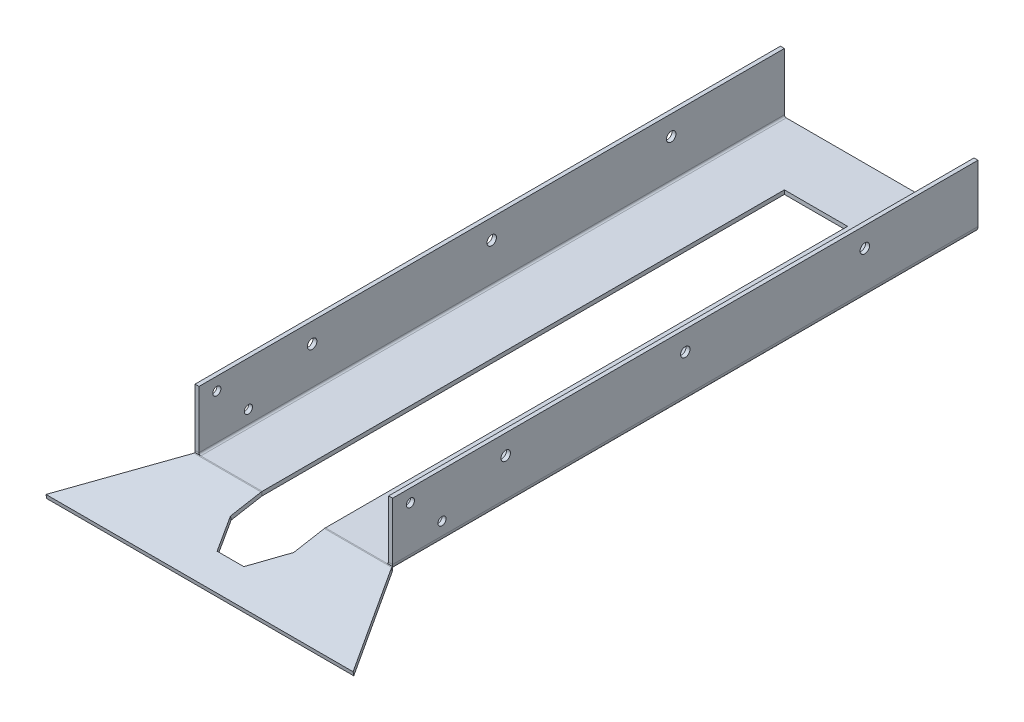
ISO-10303-21;
HEADER;
FILE_DESCRIPTION(('STEP AP214'),'2;1');
FILE_NAME('part.step','',(''),(''),'','','');
FILE_SCHEMA(('AUTOMOTIVE_DESIGN { 1 0 10303 214 1 1 1 1 }'));
ENDSEC;
DATA;
#1=APPLICATION_CONTEXT('core data for automotive mechanical design processes');
#2=APPLICATION_PROTOCOL_DEFINITION('international standard','automotive_design',2000,#1);
#3=PRODUCT_CONTEXT('',#1,'mechanical');
#4=PRODUCT('Part','Part','',(#3));
#5=PRODUCT_RELATED_PRODUCT_CATEGORY('part','',(#4));
#6=PRODUCT_DEFINITION_FORMATION('','',#4);
#7=PRODUCT_DEFINITION_CONTEXT('part definition',#1,'design');
#8=PRODUCT_DEFINITION('design','',#6,#7);
#9=PRODUCT_DEFINITION_SHAPE('','',#8);
#10=(LENGTH_UNIT() NAMED_UNIT(*) SI_UNIT(.MILLI.,.METRE.));
#11=(NAMED_UNIT(*) PLANE_ANGLE_UNIT() SI_UNIT($,.RADIAN.));
#12=(NAMED_UNIT(*) SI_UNIT($,.STERADIAN.) SOLID_ANGLE_UNIT());
#13=UNCERTAINTY_MEASURE_WITH_UNIT(LENGTH_MEASURE(1.E-05),#10,'distance_accuracy_value','');
#14=(GEOMETRIC_REPRESENTATION_CONTEXT(3) GLOBAL_UNCERTAINTY_ASSIGNED_CONTEXT((#13)) GLOBAL_UNIT_ASSIGNED_CONTEXT((#10,
#11,#12)) REPRESENTATION_CONTEXT('',''));
#15=CARTESIAN_POINT('',(0.,0.,0.));
#16=DIRECTION('',(0.,0.,1.));
#17=DIRECTION('',(1.,0.,0.));
#18=AXIS2_PLACEMENT_3D('',#15,#16,#17);
#19=CARTESIAN_POINT('',(-39.6875,0.,112.95787132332));
#20=DIRECTION('',(0.,0.,-1.));
#21=DIRECTION('',(0.,1.,0.));
#22=AXIS2_PLACEMENT_3D('',#19,#20,#21);
#23=PLANE('',#22);
#24=DIRECTION('',(-1.,0.,0.));
#25=VECTOR('',#24,1.);
#26=CARTESIAN_POINT('',(-39.7247068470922,0.,112.95787132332));
#27=LINE('',#26,#25);
#28=CARTESIAN_POINT('',(-39.6875,0.,112.95787132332));
#29=VERTEX_POINT('',#28);
#30=CARTESIAN_POINT('',(-39.5683687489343,0.,112.95787132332));
#31=VERTEX_POINT('',#30);
#32=EDGE_CURVE('E574',#29,#31,#27,.F.);
#33=ORIENTED_EDGE('',*,*,#32,.T.);
#34=CARTESIAN_POINT('',(-37.3507,0.736599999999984,112.95787132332));
#35=DIRECTION('',(0.,0.,1.));
#36=DIRECTION('',(0.,-1.,0.));
#37=AXIS2_PLACEMENT_3D('',#34,#35,#36);
#38=CIRCLE('',#37,2.3368);
#39=CARTESIAN_POINT('',(-37.3507,-1.6002,112.95787132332));
#40=VERTEX_POINT('',#39);
#41=EDGE_CURVE('E13',#31,#40,#38,.T.);
#42=ORIENTED_EDGE('',*,*,#41,.T.);
#43=DIRECTION('',(-1.,0.,0.));
#44=VECTOR('',#43,1.);
#45=CARTESIAN_POINT('',(-39.7247068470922,-1.6002,112.95787132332));
#46=LINE('',#45,#44);
#47=CARTESIAN_POINT('',(-39.6875,-1.6002,112.95787132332));
#48=VERTEX_POINT('',#47);
#49=EDGE_CURVE('E563',#48,#40,#46,.F.);
#50=ORIENTED_EDGE('',*,*,#49,.F.);
#51=DIRECTION('',(0.,1.,0.));
#52=VECTOR('',#51,1.);
#53=CARTESIAN_POINT('',(-39.6875,-1.6002,112.95787132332));
#54=LINE('',#53,#52);
#55=EDGE_CURVE('E620',#48,#29,#54,.T.);
#56=ORIENTED_EDGE('',*,*,#55,.T.);
#57=EDGE_LOOP('',(#33,#42,#50,#56));
#58=FACE_BOUND('',#57,.T.);
#59=ADVANCED_FACE('F97',(#58),#23,.T.);
#60=CARTESIAN_POINT('',(37.3507,0.,112.95787132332));
#61=DIRECTION('',(0.,0.,-1.));
#62=DIRECTION('',(0.,1.,0.));
#63=AXIS2_PLACEMENT_3D('',#60,#61,#62);
#64=PLANE('',#63);
#65=DIRECTION('',(-1.,0.,0.));
#66=VECTOR('',#65,1.);
#67=CARTESIAN_POINT('',(-39.7247068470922,-1.6002,112.95787132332));
#68=LINE('',#67,#66);
#69=CARTESIAN_POINT('',(39.6875,-1.6002,112.95787132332));
#70=VERTEX_POINT('',#69);
#71=CARTESIAN_POINT('',(37.3507,-1.6002,112.95787132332));
#72=VERTEX_POINT('',#71);
#73=EDGE_CURVE('E408',#70,#72,#68,.T.);
#74=ORIENTED_EDGE('',*,*,#73,.T.);
#75=CARTESIAN_POINT('',(37.3507,0.7366,112.95787132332));
#76=DIRECTION('',(0.,0.,-1.));
#77=DIRECTION('',(-1.,0.,0.));
#78=AXIS2_PLACEMENT_3D('',#75,#76,#77);
#79=CIRCLE('',#78,2.3368);
#80=CARTESIAN_POINT('',(39.5683687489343,0.,112.95787132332));
#81=VERTEX_POINT('',#80);
#82=EDGE_CURVE('E389',#72,#81,#79,.F.);
#83=ORIENTED_EDGE('',*,*,#82,.T.);
#84=DIRECTION('',(1.,0.,0.));
#85=VECTOR('',#84,1.);
#86=CARTESIAN_POINT('',(37.3507,0.,112.95787132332));
#87=LINE('',#86,#85);
#88=CARTESIAN_POINT('',(39.6875,0.,112.95787132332));
#89=VERTEX_POINT('',#88);
#90=EDGE_CURVE('E404',#81,#89,#87,.T.);
#91=ORIENTED_EDGE('',*,*,#90,.T.);
#92=DIRECTION('',(0.,1.,0.));
#93=VECTOR('',#92,1.);
#94=CARTESIAN_POINT('',(39.6875,-1.6002,112.95787132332));
#95=LINE('',#94,#93);
#96=EDGE_CURVE('E611',#70,#89,#95,.T.);
#97=ORIENTED_EDGE('',*,*,#96,.F.);
#98=EDGE_LOOP('',(#74,#83,#91,#97));
#99=FACE_BOUND('',#98,.T.);
#100=ADVANCED_FACE('F709',(#99),#64,.T.);
#101=CARTESIAN_POINT('',(0.,-1.6002,0.));
#102=DIRECTION('',(0.,-1.,0.));
#103=DIRECTION('',(0.,0.,-1.));
#104=AXIS2_PLACEMENT_3D('',#101,#102,#103);
#105=PLANE('',#104);
#106=CARTESIAN_POINT('',(-12.7,-1.6002,112.95787132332));
#107=VERTEX_POINT('',#106);
#108=EDGE_CURVE('E567',#40,#107,#46,.F.);
#109=ORIENTED_EDGE('',*,*,#108,.F.);
#110=DIRECTION('',(0.,0.,1.));
#111=VECTOR('',#110,1.);
#112=CARTESIAN_POINT('',(-37.3507,-1.60020000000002,112.95787132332));
#113=LINE('',#112,#111);
#114=CARTESIAN_POINT('',(-37.3507,-1.6002,-122.2375));
#115=VERTEX_POINT('',#114);
#116=EDGE_CURVE('E123',#40,#115,#113,.F.);
#117=ORIENTED_EDGE('',*,*,#116,.T.);
#118=DIRECTION('',(-1.,0.,0.));
#119=VECTOR('',#118,1.);
#120=CARTESIAN_POINT('',(-39.6875,-1.6002,-122.2375));
#121=LINE('',#120,#119);
#122=CARTESIAN_POINT('',(37.3507,-1.6002,-122.2375));
#123=VERTEX_POINT('',#122);
#124=EDGE_CURVE('E106',#123,#115,#121,.T.);
#125=ORIENTED_EDGE('',*,*,#124,.F.);
#126=DIRECTION('',(0.,0.,-1.));
#127=VECTOR('',#126,1.);
#128=CARTESIAN_POINT('',(37.3507,-1.6002,-122.2375));
#129=LINE('',#128,#127);
#130=EDGE_CURVE('E384',#123,#72,#129,.F.);
#131=ORIENTED_EDGE('',*,*,#130,.T.);
#132=CARTESIAN_POINT('',(12.7,-1.6002,112.95787132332));
#133=VERTEX_POINT('',#132);
#134=EDGE_CURVE('E568',#133,#72,#46,.F.);
#135=ORIENTED_EDGE('',*,*,#134,.F.);
#136=DIRECTION('',(0.,0.,-1.));
#137=VECTOR('',#136,1.);
#138=CARTESIAN_POINT('',(12.7,-1.6002,113.091973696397));
#139=LINE('',#138,#137);
#140=CARTESIAN_POINT('',(12.7,-1.6002,-96.8375));
#141=VERTEX_POINT('',#140);
#142=EDGE_CURVE('E490',#141,#133,#139,.F.);
#143=ORIENTED_EDGE('',*,*,#142,.F.);
#144=DIRECTION('',(1.,0.,0.));
#145=VECTOR('',#144,1.);
#146=CARTESIAN_POINT('',(-26.19375,-1.6002,-96.8375));
#147=LINE('',#146,#145);
#148=CARTESIAN_POINT('',(-12.7,-1.6002,-96.8375));
#149=VERTEX_POINT('',#148);
#150=EDGE_CURVE('E477',#149,#141,#147,.T.);
#151=ORIENTED_EDGE('',*,*,#150,.F.);
#152=DIRECTION('',(0.,0.,-1.));
#153=VECTOR('',#152,1.);
#154=CARTESIAN_POINT('',(-12.7,-1.6002,113.091973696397));
#155=LINE('',#154,#153);
#156=EDGE_CURVE('E508',#107,#149,#155,.T.);
#157=ORIENTED_EDGE('',*,*,#156,.F.);
#158=EDGE_LOOP('',(#109,#117,#125,#131,#135,#143,#151,#157));
#159=FACE_BOUND('',#158,.T.);
#160=ADVANCED_FACE('F715',(#159),#105,.T.);
#161=CARTESIAN_POINT('',(0.,0.,0.));
#162=DIRECTION('',(0.,-1.,0.));
#163=DIRECTION('',(0.,0.,-1.));
#164=AXIS2_PLACEMENT_3D('',#161,#162,#163);
#165=PLANE('',#164);
#166=DIRECTION('',(0.,0.,1.));
#167=VECTOR('',#166,1.);
#168=CARTESIAN_POINT('',(-37.3507,0.,112.95787132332));
#169=LINE('',#168,#167);
#170=CARTESIAN_POINT('',(-37.3507,0.,112.95787132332));
#171=VERTEX_POINT('',#170);
#172=CARTESIAN_POINT('',(-37.3507,0.,-122.2375));
#173=VERTEX_POINT('',#172);
#174=EDGE_CURVE('E344',#171,#173,#169,.F.);
#175=ORIENTED_EDGE('',*,*,#174,.F.);
#176=CARTESIAN_POINT('',(-12.7,0.,112.95787132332));
#177=VERTEX_POINT('',#176);
#178=EDGE_CURVE('E1370',#171,#177,#27,.F.);
#179=ORIENTED_EDGE('',*,*,#178,.T.);
#180=DIRECTION('',(0.,0.,-1.));
#181=VECTOR('',#180,1.);
#182=CARTESIAN_POINT('',(-12.7,0.,112.95787132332));
#183=LINE('',#182,#181);
#184=CARTESIAN_POINT('',(-12.7,0.,-96.8375));
#185=VERTEX_POINT('',#184);
#186=EDGE_CURVE('E513',#177,#185,#183,.T.);
#187=ORIENTED_EDGE('',*,*,#186,.T.);
#188=DIRECTION('',(1.,0.,0.));
#189=VECTOR('',#188,1.);
#190=CARTESIAN_POINT('',(-12.7,0.,-96.8375));
#191=LINE('',#190,#189);
#192=CARTESIAN_POINT('',(12.7,0.,-96.8375));
#193=VERTEX_POINT('',#192);
#194=EDGE_CURVE('E485',#185,#193,#191,.T.);
#195=ORIENTED_EDGE('',*,*,#194,.T.);
#196=DIRECTION('',(0.,0.,1.));
#197=VECTOR('',#196,1.);
#198=CARTESIAN_POINT('',(12.7,0.,-96.8375));
#199=LINE('',#198,#197);
#200=CARTESIAN_POINT('',(12.7,0.,112.95787132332));
#201=VERTEX_POINT('',#200);
#202=EDGE_CURVE('E498',#193,#201,#199,.T.);
#203=ORIENTED_EDGE('',*,*,#202,.T.);
#204=CARTESIAN_POINT('',(37.3507,0.,112.95787132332));
#205=VERTEX_POINT('',#204);
#206=EDGE_CURVE('E610',#201,#205,#27,.F.);
#207=ORIENTED_EDGE('',*,*,#206,.T.);
#208=DIRECTION('',(0.,0.,-1.));
#209=VECTOR('',#208,1.);
#210=CARTESIAN_POINT('',(37.3507,0.,-122.2375));
#211=LINE('',#210,#209);
#212=CARTESIAN_POINT('',(37.3507,0.,-122.2375));
#213=VERTEX_POINT('',#212);
#214=EDGE_CURVE('E398',#213,#205,#211,.F.);
#215=ORIENTED_EDGE('',*,*,#214,.F.);
#216=DIRECTION('',(-1.,0.,0.));
#217=VECTOR('',#216,1.);
#218=CARTESIAN_POINT('',(-39.6875,0.,-122.2375));
#219=LINE('',#218,#217);
#220=EDGE_CURVE('E619',#213,#173,#219,.T.);
#221=ORIENTED_EDGE('',*,*,#220,.T.);
#222=EDGE_LOOP('',(#175,#179,#187,#195,#203,#207,#215,#221));
#223=FACE_BOUND('',#222,.T.);
#224=ADVANCED_FACE('F815',(#223),#165,.F.);
#225=CARTESIAN_POINT('',(-39.6875,-1.6002,-122.2375));
#226=DIRECTION('',(0.,0.,-1.));
#227=DIRECTION('',(-1.,0.,0.));
#228=AXIS2_PLACEMENT_3D('',#225,#226,#227);
#229=PLANE('',#228);
#230=DIRECTION('',(0.,-1.,0.));
#231=VECTOR('',#230,1.);
#232=CARTESIAN_POINT('',(-37.3507,0.,-122.2375));
#233=LINE('',#232,#231);
#234=EDGE_CURVE('E338',#173,#115,#233,.T.);
#235=ORIENTED_EDGE('',*,*,#234,.F.);
#236=ORIENTED_EDGE('',*,*,#220,.F.);
#237=DIRECTION('',(0.,-1.,0.));
#238=VECTOR('',#237,1.);
#239=CARTESIAN_POINT('',(37.3507,0.,-122.2375));
#240=LINE('',#239,#238);
#241=EDGE_CURVE('E392',#213,#123,#240,.T.);
#242=ORIENTED_EDGE('',*,*,#241,.T.);
#243=ORIENTED_EDGE('',*,*,#124,.T.);
#244=EDGE_LOOP('',(#235,#236,#242,#243));
#245=FACE_BOUND('',#244,.T.);
#246=ADVANCED_FACE('F99',(#245),#229,.T.);
#247=CARTESIAN_POINT('',(-39.7247068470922,-2.33679999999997,112.95787132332));
#248=DIRECTION('',(-1.,0.,0.));
#249=DIRECTION('',(0.,0.984807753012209,0.173648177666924));
#250=AXIS2_PLACEMENT_3D('',#247,#248,#249);
#251=CYLINDRICAL_SURFACE('',#250,2.33679999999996);
#252=DIRECTION('',(-1.,0.,0.));
#253=VECTOR('',#252,1.);
#254=CARTESIAN_POINT('',(0.,-0.0355012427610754,113.363652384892));
#255=LINE('',#254,#253);
#256=CARTESIAN_POINT('',(-12.7,-0.0355012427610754,113.363652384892));
#257=VERTEX_POINT('',#256);
#258=CARTESIAN_POINT('',(-39.7247068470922,-0.0355012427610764,113.363652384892));
#259=VERTEX_POINT('',#258);
#260=EDGE_CURVE('E553',#257,#259,#255,.T.);
#261=ORIENTED_EDGE('',*,*,#260,.F.);
#262=CARTESIAN_POINT('',(-12.7,-2.3368,112.95787132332));
#263=DIRECTION('',(-1.,0.,0.));
#264=DIRECTION('',(0.,0.,1.));
#265=AXIS2_PLACEMENT_3D('',#262,#263,#264);
#266=CIRCLE('',#265,2.3368);
#267=EDGE_CURVE('E523',#177,#257,#266,.F.);
#268=ORIENTED_EDGE('',*,*,#267,.F.);
#269=ORIENTED_EDGE('',*,*,#178,.F.);
#270=EDGE_CURVE('E115',#31,#171,#27,.F.);
#271=ORIENTED_EDGE('',*,*,#270,.F.);
#272=ORIENTED_EDGE('',*,*,#32,.F.);
#273=CARTESIAN_POINT('',(-39.7247068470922,-0.0355012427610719,113.363652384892));
#274=CARTESIAN_POINT('',(-39.7231565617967,-0.0325502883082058,113.346916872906));
#275=CARTESIAN_POINT('',(-39.7216062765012,-0.029781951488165,113.330149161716));
#276=CARTESIAN_POINT('',(-39.7185057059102,-0.0246116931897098,113.296557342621));
#277=CARTESIAN_POINT('',(-39.7169554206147,-0.0222097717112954,113.279733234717));
#278=CARTESIAN_POINT('',(-39.7138548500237,-0.0177735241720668,113.246036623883));
#279=CARTESIAN_POINT('',(-39.7123045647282,-0.0157391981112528,113.229164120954));
#280=CARTESIAN_POINT('',(-39.7092039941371,-0.012039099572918,113.195378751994));
#281=CARTESIAN_POINT('',(-39.7076537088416,-0.0103733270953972,113.178465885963));
#282=CARTESIAN_POINT('',(-39.7045531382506,-0.00741113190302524,113.144607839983));
#283=CARTESIAN_POINT('',(-39.7030028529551,-0.00611470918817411,113.127662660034));
#284=CARTESIAN_POINT('',(-39.6999022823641,-0.00389182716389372,113.093748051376));
#285=CARTESIAN_POINT('',(-39.6983519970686,-0.00296536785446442,113.076778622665));
#286=CARTESIAN_POINT('',(-39.6952514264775,-0.00148286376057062,113.042823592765));
#287=CARTESIAN_POINT('',(-39.693701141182,-0.000926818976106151,113.025837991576));
#288=CARTESIAN_POINT('',(-39.690600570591,-0.000185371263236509,112.991858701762));
#289=CARTESIAN_POINT('',(-39.6890502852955,3.1665168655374E-08,112.974865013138));
#290=CARTESIAN_POINT('',(-39.6875,0.,112.95787132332));
#291=B_SPLINE_CURVE_WITH_KNOTS('',3,(#273,#274,#275,#276,#277,#278,#279,#280,#281,#282,#283,
#284,#285,#286,#287,#288,#289,#290),.UNSPECIFIED.,.F.,.F.,(4,2,2,2,2,2,2,2,4),(0.,
0.0511917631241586,0.102383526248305,0.153575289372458,0.204767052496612,0.255958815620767,
0.307150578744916,0.358342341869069,0.409534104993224),.UNSPECIFIED.);
#292=EDGE_CURVE('E573',#259,#29,#291,.T.);
#293=ORIENTED_EDGE('',*,*,#292,.F.);
#294=EDGE_LOOP('',(#261,#268,#269,#271,#272,#293));
#295=FACE_BOUND('',#294,.T.);
#296=ADVANCED_FACE('F589',(#295),#251,.T.);
#297=ORIENTED_EDGE('',*,*,#206,.F.);
#298=CARTESIAN_POINT('',(12.7,-2.3368,112.95787132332));
#299=DIRECTION('',(-1.,0.,0.));
#300=DIRECTION('',(0.,0.,1.));
#301=AXIS2_PLACEMENT_3D('',#298,#299,#300);
#302=CIRCLE('',#301,2.3368);
#303=CARTESIAN_POINT('',(12.7,-0.0355012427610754,113.363652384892));
#304=VERTEX_POINT('',#303);
#305=EDGE_CURVE('E516',#304,#201,#302,.T.);
#306=ORIENTED_EDGE('',*,*,#305,.F.);
#307=CARTESIAN_POINT('',(39.7247068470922,-0.035501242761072,113.363652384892));
#308=VERTEX_POINT('',#307);
#309=EDGE_CURVE('E550',#308,#304,#255,.T.);
#310=ORIENTED_EDGE('',*,*,#309,.F.);
#311=CARTESIAN_POINT('',(39.6875,0.,112.95787132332));
#312=CARTESIAN_POINT('',(39.6890502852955,3.16651686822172E-08,112.974865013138));
#313=CARTESIAN_POINT('',(39.690600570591,-0.000185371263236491,112.991858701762));
#314=CARTESIAN_POINT('',(39.693701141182,-0.00092681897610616,113.025837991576));
#315=CARTESIAN_POINT('',(39.6952514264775,-0.00148286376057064,113.042823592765));
#316=CARTESIAN_POINT('',(39.6983519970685,-0.00296536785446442,113.076778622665));
#317=CARTESIAN_POINT('',(39.6999022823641,-0.0038918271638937,113.093748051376));
#318=CARTESIAN_POINT('',(39.7030028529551,-0.0061147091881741,113.127662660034));
#319=CARTESIAN_POINT('',(39.7045531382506,-0.00741113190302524,113.144607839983));
#320=CARTESIAN_POINT('',(39.7076537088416,-0.0103733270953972,113.178465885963));
#321=CARTESIAN_POINT('',(39.7092039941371,-0.012039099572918,113.195378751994));
#322=CARTESIAN_POINT('',(39.7123045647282,-0.0157391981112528,113.229164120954));
#323=CARTESIAN_POINT('',(39.7138548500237,-0.0177735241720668,113.246036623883));
#324=CARTESIAN_POINT('',(39.7169554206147,-0.0222097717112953,113.279733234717));
#325=CARTESIAN_POINT('',(39.7185057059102,-0.0246116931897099,113.296557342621));
#326=CARTESIAN_POINT('',(39.7216062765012,-0.0297819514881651,113.330149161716));
#327=CARTESIAN_POINT('',(39.7231565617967,-0.0325502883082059,113.346916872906));
#328=CARTESIAN_POINT('',(39.7247068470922,-0.0355012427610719,113.363652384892));
#329=B_SPLINE_CURVE_WITH_KNOTS('',3,(#311,#312,#313,#314,#315,#316,#317,#318,#319,#320,#321,
#322,#323,#324,#325,#326,#327,#328),.UNSPECIFIED.,.F.,.F.,(4,2,2,2,2,2,2,2,4),(0.,
0.0511917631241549,0.102383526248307,0.153575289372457,0.204767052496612,0.255958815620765,
0.307150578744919,0.358342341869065,0.409534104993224),.UNSPECIFIED.);
#330=EDGE_CURVE('E601',#89,#308,#329,.T.);
#331=ORIENTED_EDGE('',*,*,#330,.F.);
#332=ORIENTED_EDGE('',*,*,#90,.F.);
#333=EDGE_CURVE('E405',#205,#81,#87,.T.);
#334=ORIENTED_EDGE('',*,*,#333,.F.);
#335=EDGE_LOOP('',(#297,#306,#310,#331,#332,#334));
#336=FACE_BOUND('',#335,.T.);
#337=ADVANCED_FACE('F587',(#336),#251,.T.);
#338=CARTESIAN_POINT('',(-39.7247068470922,-2.33679999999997,112.95787132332));
#339=DIRECTION('',(-1.,0.,0.));
#340=DIRECTION('',(0.,0.984807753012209,0.173648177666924));
#341=AXIS2_PLACEMENT_3D('',#338,#339,#340);
#342=CYLINDRICAL_SURFACE('',#341,0.736599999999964);
#343=CARTESIAN_POINT('',(-12.7,-2.3368,112.95787132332));
#344=DIRECTION('',(1.,0.,0.));
#345=DIRECTION('',(0.,0.,1.));
#346=AXIS2_PLACEMENT_3D('',#343,#344,#345);
#347=CIRCLE('',#346,0.7366);
#348=CARTESIAN_POINT('',(-12.7,-1.61139060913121,113.08578057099));
#349=VERTEX_POINT('',#348);
#350=EDGE_CURVE('E525',#107,#349,#347,.T.);
#351=ORIENTED_EDGE('',*,*,#350,.T.);
#352=DIRECTION('',(1.,0.,0.));
#353=VECTOR('',#352,1.);
#354=CARTESIAN_POINT('',(39.7247068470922,-1.61139060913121,113.08578057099));
#355=LINE('',#354,#353);
#356=CARTESIAN_POINT('',(-39.7247068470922,-1.61139060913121,113.08578057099));
#357=VERTEX_POINT('',#356);
#358=EDGE_CURVE('E560',#349,#357,#355,.F.);
#359=ORIENTED_EDGE('',*,*,#358,.T.);
#360=CARTESIAN_POINT('',(-39.7247068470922,-1.61139060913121,113.08578057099));
#361=CARTESIAN_POINT('',(-39.7231565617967,-1.61046041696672,113.080505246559));
#362=CARTESIAN_POINT('',(-39.7216062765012,-1.60958778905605,113.07521977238));
#363=CARTESIAN_POINT('',(-39.7185057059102,-1.60795803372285,113.064631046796));
#364=CARTESIAN_POINT('',(-39.7169554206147,-1.6072009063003,113.059327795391));
#365=CARTESIAN_POINT('',(-39.7138548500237,-1.60580252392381,113.048706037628));
#366=CARTESIAN_POINT('',(-39.7123045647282,-1.60516126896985,113.04338753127));
#367=CARTESIAN_POINT('',(-39.7092039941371,-1.60399493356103,113.032737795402));
#368=CARTESIAN_POINT('',(-39.7076537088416,-1.60346985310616,113.027406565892));
#369=CARTESIAN_POINT('',(-39.7045531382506,-1.60253611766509,113.016733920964));
#370=CARTESIAN_POINT('',(-39.7030028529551,-1.60212746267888,113.011392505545));
#371=CARTESIAN_POINT('',(-39.6999022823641,-1.60142677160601,113.000702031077));
#372=CARTESIAN_POINT('',(-39.6983519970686,-1.60113473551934,112.995352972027));
#373=CARTESIAN_POINT('',(-39.6952514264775,-1.60066742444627,112.98464975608));
#374=CARTESIAN_POINT('',(-39.693701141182,-1.60049214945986,112.979295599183));
#375=CARTESIAN_POINT('',(-39.690600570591,-1.60025843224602,112.96858473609));
#376=CARTESIAN_POINT('',(-39.6890502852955,-1.60019999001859,112.963228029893));
#377=CARTESIAN_POINT('',(-39.6875,-1.6002,112.95787132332));
#378=B_SPLINE_CURVE_WITH_KNOTS('',3,(#360,#361,#362,#363,#364,#365,#366,#367,#368,#369,#370,
#371,#372,#373,#374,#375,#376,#377),.UNSPECIFIED.,.F.,.F.,(4,2,2,2,2,2,2,2,4),(0.,
0.0167292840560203,0.0334585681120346,0.0501878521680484,0.066917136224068,0.0836464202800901,
0.100375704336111,0.11710498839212,0.133834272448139),.UNSPECIFIED.);
#379=EDGE_CURVE('E532',#357,#48,#378,.T.);
#380=ORIENTED_EDGE('',*,*,#379,.T.);
#381=ORIENTED_EDGE('',*,*,#49,.T.);
#382=ORIENTED_EDGE('',*,*,#108,.T.);
#383=EDGE_LOOP('',(#351,#359,#380,#381,#382));
#384=FACE_BOUND('',#383,.T.);
#385=ADVANCED_FACE('F576',(#384),#342,.F.);
#386=CARTESIAN_POINT('',(12.7,-2.3368,112.95787132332));
#387=DIRECTION('',(-1.,0.,0.));
#388=DIRECTION('',(0.,0.,-1.));
#389=AXIS2_PLACEMENT_3D('',#386,#387,#388);
#390=CIRCLE('',#389,0.7366);
#391=CARTESIAN_POINT('',(12.7,-1.61139060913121,113.08578057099));
#392=VERTEX_POINT('',#391);
#393=EDGE_CURVE('E520',#392,#133,#390,.T.);
#394=ORIENTED_EDGE('',*,*,#393,.T.);
#395=ORIENTED_EDGE('',*,*,#134,.T.);
#396=ORIENTED_EDGE('',*,*,#73,.F.);
#397=CARTESIAN_POINT('',(39.6875,-1.6002,112.95787132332));
#398=CARTESIAN_POINT('',(39.6890502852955,-1.60019999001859,112.963228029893));
#399=CARTESIAN_POINT('',(39.690600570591,-1.60025843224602,112.96858473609));
#400=CARTESIAN_POINT('',(39.693701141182,-1.60049214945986,112.979295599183));
#401=CARTESIAN_POINT('',(39.6952514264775,-1.60066742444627,112.98464975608));
#402=CARTESIAN_POINT('',(39.6983519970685,-1.60113473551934,112.995352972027));
#403=CARTESIAN_POINT('',(39.6999022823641,-1.60142677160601,113.000702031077));
#404=CARTESIAN_POINT('',(39.7030028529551,-1.60212746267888,113.011392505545));
#405=CARTESIAN_POINT('',(39.7045531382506,-1.60253611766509,113.016733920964));
#406=CARTESIAN_POINT('',(39.7076537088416,-1.60346985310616,113.027406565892));
#407=CARTESIAN_POINT('',(39.7092039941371,-1.60399493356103,113.032737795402));
#408=CARTESIAN_POINT('',(39.7123045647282,-1.60516126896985,113.04338753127));
#409=CARTESIAN_POINT('',(39.7138548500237,-1.60580252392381,113.048706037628));
#410=CARTESIAN_POINT('',(39.7169554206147,-1.6072009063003,113.059327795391));
#411=CARTESIAN_POINT('',(39.7185057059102,-1.60795803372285,113.064631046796));
#412=CARTESIAN_POINT('',(39.7216062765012,-1.60958778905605,113.07521977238));
#413=CARTESIAN_POINT('',(39.7231565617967,-1.61046041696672,113.080505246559));
#414=CARTESIAN_POINT('',(39.7247068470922,-1.61139060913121,113.08578057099));
#415=B_SPLINE_CURVE_WITH_KNOTS('',3,(#397,#398,#399,#400,#401,#402,#403,#404,#405,#406,#407,
#408,#409,#410,#411,#412,#413,#414),.UNSPECIFIED.,.F.,.F.,(4,2,2,2,2,2,2,2,4),(0.,
0.0167292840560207,0.0334585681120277,0.0501878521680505,0.0669171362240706,0.0836464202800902,
0.100375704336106,0.117104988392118,0.133834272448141),.UNSPECIFIED.);
#416=CARTESIAN_POINT('',(39.7247068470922,-1.61139060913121,113.08578057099));
#417=VERTEX_POINT('',#416);
#418=EDGE_CURVE('E566',#70,#417,#415,.T.);
#419=ORIENTED_EDGE('',*,*,#418,.T.);
#420=EDGE_CURVE('E557',#417,#392,#355,.F.);
#421=ORIENTED_EDGE('',*,*,#420,.T.);
#422=EDGE_LOOP('',(#394,#395,#396,#419,#421));
#423=FACE_BOUND('',#422,.T.);
#424=ADVANCED_FACE('F586',(#423),#342,.F.);
#425=CARTESIAN_POINT('',(0.,20.9277849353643,-5.52505139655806));
#426=DIRECTION('',(0.,0.984807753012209,0.173648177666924));
#427=DIRECTION('',(0.,-0.173648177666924,0.984807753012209));
#428=AXIS2_PLACEMENT_3D('',#425,#426,#427);
#429=PLANE('',#428);
#430=DIRECTION('',(-0.494270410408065,0.150953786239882,-0.856101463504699));
#431=VECTOR('',#430,1.);
#432=CARTESIAN_POINT('',(-5.3676515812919,-4.44994984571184,138.399234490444));
#433=LINE('',#432,#431);
#434=CARTESIAN_POINT('',(-5.3676515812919,-4.44994984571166,138.399234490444));
#435=VERTEX_POINT('',#434);
#436=CARTESIAN_POINT('',(-12.7,-2.21059719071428,125.699234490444));
#437=VERTEX_POINT('',#436);
#438=EDGE_CURVE('E457',#435,#437,#433,.T.);
#439=ORIENTED_EDGE('',*,*,#438,.T.);
#440=DIRECTION('',(0.,0.173648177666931,-0.984807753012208));
#441=VECTOR('',#440,1.);
#442=CARTESIAN_POINT('',(-12.7,-2.21059719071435,125.699234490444));
#443=LINE('',#442,#441);
#444=EDGE_CURVE('E466',#437,#257,#443,.T.);
#445=ORIENTED_EDGE('',*,*,#444,.T.);
#446=ORIENTED_EDGE('',*,*,#260,.T.);
#447=DIRECTION('',(0.499999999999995,0.15038373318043,-0.852868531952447));
#448=VECTOR('',#447,1.);
#449=CARTESIAN_POINT('',(22.4809556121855,18.673938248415,7.25714834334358));
#450=LINE('',#449,#448);
#451=CARTESIAN_POINT('',(-61.6845452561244,-6.64030620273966,150.821362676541));
#452=VERTEX_POINT('',#451);
#453=EDGE_CURVE('E541',#259,#452,#450,.F.);
#454=ORIENTED_EDGE('',*,*,#453,.T.);
#455=DIRECTION('',(-1.,0.,0.));
#456=VECTOR('',#455,1.);
#457=CARTESIAN_POINT('',(0.,-6.64030620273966,150.821362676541));
#458=LINE('',#457,#456);
#459=CARTESIAN_POINT('',(61.6845452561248,-6.64030620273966,150.821362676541));
#460=VERTEX_POINT('',#459);
#461=EDGE_CURVE('E539',#452,#460,#458,.F.);
#462=ORIENTED_EDGE('',*,*,#461,.T.);
#463=DIRECTION('',(0.500000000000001,-0.150383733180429,0.852868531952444));
#464=VECTOR('',#463,1.);
#465=CARTESIAN_POINT('',(-22.4809556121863,18.6739382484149,7.25714834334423));
#466=LINE('',#465,#464);
#467=EDGE_CURVE('E536',#460,#308,#466,.F.);
#468=ORIENTED_EDGE('',*,*,#467,.T.);
#469=ORIENTED_EDGE('',*,*,#309,.T.);
#470=DIRECTION('',(0.,-0.173648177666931,0.984807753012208));
#471=VECTOR('',#470,1.);
#472=CARTESIAN_POINT('',(12.7,0.0110720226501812,113.099522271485));
#473=LINE('',#472,#471);
#474=CARTESIAN_POINT('',(12.7,-2.21059719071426,125.699234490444));
#475=VERTEX_POINT('',#474);
#476=EDGE_CURVE('E418',#304,#475,#473,.T.);
#477=ORIENTED_EDGE('',*,*,#476,.T.);
#478=DIRECTION('',(-0.494270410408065,-0.150953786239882,0.856101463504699));
#479=VECTOR('',#478,1.);
#480=CARTESIAN_POINT('',(12.7,-2.21059719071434,125.699234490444));
#481=LINE('',#480,#479);
#482=CARTESIAN_POINT('',(5.3676515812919,-4.44994984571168,138.399234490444));
#483=VERTEX_POINT('',#482);
#484=EDGE_CURVE('E431',#475,#483,#481,.T.);
#485=ORIENTED_EDGE('',*,*,#484,.T.);
#486=DIRECTION('',(-1.,0.,0.));
#487=VECTOR('',#486,1.);
#488=CARTESIAN_POINT('',(5.3676515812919,-4.44994984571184,138.399234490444));
#489=LINE('',#488,#487);
#490=EDGE_CURVE('E444',#483,#435,#489,.T.);
#491=ORIENTED_EDGE('',*,*,#490,.T.);
#492=EDGE_LOOP('',(#439,#445,#446,#454,#462,#468,#469,#477,#485,#491));
#493=FACE_BOUND('',#492,.T.);
#494=ADVANCED_FACE('F764',(#493),#429,.T.);
#495=CARTESIAN_POINT('',(0.,19.3518955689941,-5.80292321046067));
#496=DIRECTION('',(0.,0.984807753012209,0.173648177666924));
#497=DIRECTION('',(0.,-0.173648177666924,0.984807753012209));
#498=AXIS2_PLACEMENT_3D('',#495,#496,#497);
#499=PLANE('',#498);
#500=DIRECTION('',(0.,0.173648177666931,-0.984807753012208));
#501=VECTOR('',#500,1.);
#502=CARTESIAN_POINT('',(-12.7,-1.58810397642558,112.953715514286));
#503=LINE('',#502,#501);
#504=CARTESIAN_POINT('',(-12.7,-3.78648655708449,125.421362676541));
#505=VERTEX_POINT('',#504);
#506=EDGE_CURVE('E469',#505,#349,#503,.T.);
#507=ORIENTED_EDGE('',*,*,#506,.F.);
#508=DIRECTION('',(-0.494270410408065,0.150953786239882,-0.856101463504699));
#509=VECTOR('',#508,1.);
#510=CARTESIAN_POINT('',(-5.3676515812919,-6.02583921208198,138.121362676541));
#511=LINE('',#510,#509);
#512=CARTESIAN_POINT('',(-5.3676515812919,-6.02583921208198,138.121362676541));
#513=VERTEX_POINT('',#512);
#514=EDGE_CURVE('E449',#513,#505,#511,.T.);
#515=ORIENTED_EDGE('',*,*,#514,.F.);
#516=DIRECTION('',(1.,0.,0.));
#517=VECTOR('',#516,1.);
#518=CARTESIAN_POINT('',(-26.19375,-6.02583921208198,138.121362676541));
#519=LINE('',#518,#517);
#520=CARTESIAN_POINT('',(5.3676515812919,-6.02583921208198,138.121362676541));
#521=VERTEX_POINT('',#520);
#522=EDGE_CURVE('E436',#521,#513,#519,.F.);
#523=ORIENTED_EDGE('',*,*,#522,.F.);
#524=DIRECTION('',(-0.494270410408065,-0.150953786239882,0.856101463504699));
#525=VECTOR('',#524,1.);
#526=CARTESIAN_POINT('',(12.7,-3.78648655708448,125.421362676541));
#527=LINE('',#526,#525);
#528=CARTESIAN_POINT('',(12.7,-3.7864865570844,125.421362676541));
#529=VERTEX_POINT('',#528);
#530=EDGE_CURVE('E423',#529,#521,#527,.T.);
#531=ORIENTED_EDGE('',*,*,#530,.F.);
#532=DIRECTION('',(0.,0.173648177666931,-0.984807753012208));
#533=VECTOR('',#532,1.);
#534=CARTESIAN_POINT('',(12.7,-1.58810397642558,112.953715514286));
#535=LINE('',#534,#533);
#536=EDGE_CURVE('E413',#392,#529,#535,.F.);
#537=ORIENTED_EDGE('',*,*,#536,.F.);
#538=ORIENTED_EDGE('',*,*,#420,.F.);
#539=DIRECTION('',(-0.500000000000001,0.150383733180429,-0.852868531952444));
#540=VECTOR('',#539,1.);
#541=CARTESIAN_POINT('',(39.6875,-1.6002,113.022315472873));
#542=LINE('',#541,#540);
#543=CARTESIAN_POINT('',(61.6845452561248,-8.21619556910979,150.543490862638));
#544=VERTEX_POINT('',#543);
#545=EDGE_CURVE('E543',#544,#417,#542,.T.);
#546=ORIENTED_EDGE('',*,*,#545,.F.);
#547=DIRECTION('',(1.,0.,0.));
#548=VECTOR('',#547,1.);
#549=CARTESIAN_POINT('',(61.6845452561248,-8.21619556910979,150.543490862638));
#550=LINE('',#549,#548);
#551=CARTESIAN_POINT('',(-61.6845452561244,-8.21619556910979,150.543490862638));
#552=VERTEX_POINT('',#551);
#553=EDGE_CURVE('E546',#552,#544,#550,.T.);
#554=ORIENTED_EDGE('',*,*,#553,.F.);
#555=DIRECTION('',(-0.499999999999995,-0.15038373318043,0.852868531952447));
#556=VECTOR('',#555,1.);
#557=CARTESIAN_POINT('',(-39.6875,-1.6002,113.022315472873));
#558=LINE('',#557,#556);
#559=EDGE_CURVE('E548',#357,#552,#558,.T.);
#560=ORIENTED_EDGE('',*,*,#559,.F.);
#561=ORIENTED_EDGE('',*,*,#358,.F.);
#562=EDGE_LOOP('',(#507,#515,#523,#531,#537,#538,#546,#554,#560,#561));
#563=FACE_BOUND('',#562,.T.);
#564=ADVANCED_FACE('F767',(#563),#499,.F.);
#565=CARTESIAN_POINT('',(39.6875,0.,112.95787132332));
#566=CARTESIAN_POINT('',(39.6999026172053,0.,113.093824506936));
#567=CARTESIAN_POINT('',(39.7123042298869,-0.0118932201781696,113.229764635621));
#568=CARTESIAN_POINT('',(39.7247068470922,-0.0355012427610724,113.363652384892));
#569=CARTESIAN_POINT('',(39.6875,-1.6002,112.95787132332));
#570=CARTESIAN_POINT('',(39.6999025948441,-1.6002,113.000726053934));
#571=CARTESIAN_POINT('',(39.7123042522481,-1.60394896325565,113.043576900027));
#572=CARTESIAN_POINT('',(39.7247068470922,-1.61139060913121,113.08578057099));
#573=B_SPLINE_SURFACE_WITH_KNOTS('',1,3,((#565,#566,#567,#568),(#569,#570,#571,#572)),
.UNSPECIFIED.,.F.,.F.,.F.,(2,2),(4,4),(0.,1.),(0.,1.),.UNSPECIFIED.);
#574=DIRECTION('',(0.,-0.984807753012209,-0.173648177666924));
#575=VECTOR('',#574,1.);
#576=CARTESIAN_POINT('',(39.7247068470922,-0.0355012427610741,113.363652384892));
#577=LINE('',#576,#575);
#578=EDGE_CURVE('E528',#417,#308,#577,.F.);
#579=ORIENTED_EDGE('',*,*,#578,.F.);
#580=ORIENTED_EDGE('',*,*,#418,.F.);
#581=ORIENTED_EDGE('',*,*,#96,.T.);
#582=ORIENTED_EDGE('',*,*,#330,.T.);
#583=EDGE_LOOP('',(#579,#580,#581,#582));
#584=FACE_BOUND('',#583,.T.);
#585=ADVANCED_FACE('F592',(#584),#573,.F.);
#586=CARTESIAN_POINT('',(-39.7247068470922,-0.0355012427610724,113.363652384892));
#587=CARTESIAN_POINT('',(-39.7123042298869,-0.0118932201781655,113.229764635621));
#588=CARTESIAN_POINT('',(-39.6999026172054,0.,113.093824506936));
#589=CARTESIAN_POINT('',(-39.6875,0.,112.95787132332));
#590=CARTESIAN_POINT('',(-39.7247068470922,-1.61139060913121,113.08578057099));
#591=CARTESIAN_POINT('',(-39.7123042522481,-1.60394896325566,113.043576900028));
#592=CARTESIAN_POINT('',(-39.6999025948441,-1.6002,113.000726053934));
#593=CARTESIAN_POINT('',(-39.6875,-1.6002,112.95787132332));
#594=B_SPLINE_SURFACE_WITH_KNOTS('',1,3,((#586,#587,#588,#589),(#590,#591,#592,#593)),
.UNSPECIFIED.,.F.,.F.,.F.,(2,2),(4,4),(0.,1.),(0.,1.),.UNSPECIFIED.);
#595=DIRECTION('',(0.,-0.984807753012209,-0.173648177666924));
#596=VECTOR('',#595,1.);
#597=CARTESIAN_POINT('',(-39.7247068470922,-1.61139060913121,113.08578057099));
#598=LINE('',#597,#596);
#599=EDGE_CURVE('E554',#357,#259,#598,.F.);
#600=ORIENTED_EDGE('',*,*,#379,.F.);
#601=ORIENTED_EDGE('',*,*,#599,.T.);
#602=ORIENTED_EDGE('',*,*,#292,.T.);
#603=ORIENTED_EDGE('',*,*,#55,.F.);
#604=EDGE_LOOP('',(#600,#601,#602,#603));
#605=FACE_BOUND('',#604,.T.);
#606=ADVANCED_FACE('F780',(#605),#594,.F.);
#607=CARTESIAN_POINT('',(-39.6875,-0.0243106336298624,113.300187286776));
#608=DIRECTION('',(0.866025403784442,-0.0868240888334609,0.492403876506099));
#609=DIRECTION('',(0.494270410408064,0.,-0.869308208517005));
#610=AXIS2_PLACEMENT_3D('',#607,#608,#609);
#611=PLANE('',#610);
#612=ORIENTED_EDGE('',*,*,#599,.F.);
#613=ORIENTED_EDGE('',*,*,#559,.T.);
#614=DIRECTION('',(0.,-0.984807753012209,-0.173648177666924));
#615=VECTOR('',#614,1.);
#616=CARTESIAN_POINT('',(-61.6845452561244,-6.64030620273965,150.821362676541));
#617=LINE('',#616,#615);
#618=EDGE_CURVE('E529',#452,#552,#617,.T.);
#619=ORIENTED_EDGE('',*,*,#618,.F.);
#620=ORIENTED_EDGE('',*,*,#453,.F.);
#621=EDGE_LOOP('',(#612,#613,#619,#620));
#622=FACE_BOUND('',#621,.T.);
#623=ADVANCED_FACE('F775',(#622),#611,.F.);
#624=CARTESIAN_POINT('',(39.6875,-0.0243106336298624,113.300187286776));
#625=DIRECTION('',(-0.866025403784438,-0.0868240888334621,0.492403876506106));
#626=DIRECTION('',(0.494270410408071,0.,0.869308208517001));
#627=AXIS2_PLACEMENT_3D('',#624,#625,#626);
#628=PLANE('',#627);
#629=ORIENTED_EDGE('',*,*,#578,.T.);
#630=ORIENTED_EDGE('',*,*,#467,.F.);
#631=DIRECTION('',(0.,-0.984807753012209,-0.173648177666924));
#632=VECTOR('',#631,1.);
#633=CARTESIAN_POINT('',(61.6845452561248,-6.64030620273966,150.821362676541));
#634=LINE('',#633,#632);
#635=EDGE_CURVE('E533',#460,#544,#634,.T.);
#636=ORIENTED_EDGE('',*,*,#635,.T.);
#637=ORIENTED_EDGE('',*,*,#545,.T.);
#638=EDGE_LOOP('',(#629,#630,#636,#637));
#639=FACE_BOUND('',#638,.T.);
#640=ADVANCED_FACE('F772',(#639),#628,.F.);
#641=CARTESIAN_POINT('',(61.6845452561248,-6.64030620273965,150.821362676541));
#642=DIRECTION('',(0.,0.173648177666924,-0.984807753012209));
#643=DIRECTION('',(0.,0.984807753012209,0.173648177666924));
#644=AXIS2_PLACEMENT_3D('',#641,#642,#643);
#645=PLANE('',#644);
#646=ORIENTED_EDGE('',*,*,#553,.T.);
#647=ORIENTED_EDGE('',*,*,#635,.F.);
#648=ORIENTED_EDGE('',*,*,#461,.F.);
#649=ORIENTED_EDGE('',*,*,#618,.T.);
#650=EDGE_LOOP('',(#646,#647,#648,#649));
#651=FACE_BOUND('',#650,.T.);
#652=ADVANCED_FACE('F762',(#651),#645,.F.);
#653=CARTESIAN_POINT('',(-12.7,-2.3368,112.95787132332));
#654=DIRECTION('',(-1.,0.,0.));
#655=DIRECTION('',(0.,0.,1.));
#656=AXIS2_PLACEMENT_3D('',#653,#654,#655);
#657=PLANE('',#656);
#658=DIRECTION('',(0.,1.,0.));
#659=VECTOR('',#658,1.);
#660=CARTESIAN_POINT('',(-12.7,0.,112.95787132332));
#661=LINE('',#660,#659);
#662=EDGE_CURVE('E503',#107,#177,#661,.T.);
#663=ORIENTED_EDGE('',*,*,#662,.T.);
#664=ORIENTED_EDGE('',*,*,#267,.T.);
#665=DIRECTION('',(0.,-0.98480775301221,-0.173648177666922));
#666=VECTOR('',#665,1.);
#667=CARTESIAN_POINT('',(-12.7,-0.0355012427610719,113.363652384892));
#668=LINE('',#667,#666);
#669=EDGE_CURVE('E462',#257,#349,#668,.T.);
#670=ORIENTED_EDGE('',*,*,#669,.T.);
#671=ORIENTED_EDGE('',*,*,#350,.F.);
#672=EDGE_LOOP('',(#663,#664,#670,#671));
#673=FACE_BOUND('',#672,.T.);
#674=ADVANCED_FACE('F758',(#673),#657,.F.);
#675=CARTESIAN_POINT('',(12.7,-2.3368,112.95787132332));
#676=DIRECTION('',(1.,0.,0.));
#677=DIRECTION('',(0.,0.,-1.));
#678=AXIS2_PLACEMENT_3D('',#675,#676,#677);
#679=PLANE('',#678);
#680=DIRECTION('',(0.,0.98480775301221,0.173648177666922));
#681=VECTOR('',#680,1.);
#682=CARTESIAN_POINT('',(12.7,-1.61139060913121,113.08578057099));
#683=LINE('',#682,#681);
#684=EDGE_CURVE('E410',#392,#304,#683,.T.);
#685=ORIENTED_EDGE('',*,*,#684,.T.);
#686=ORIENTED_EDGE('',*,*,#305,.T.);
#687=DIRECTION('',(0.,1.,0.));
#688=VECTOR('',#687,1.);
#689=CARTESIAN_POINT('',(12.7,0.,112.95787132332));
#690=LINE('',#689,#688);
#691=EDGE_CURVE('E495',#133,#201,#690,.T.);
#692=ORIENTED_EDGE('',*,*,#691,.F.);
#693=ORIENTED_EDGE('',*,*,#393,.F.);
#694=EDGE_LOOP('',(#685,#686,#692,#693));
#695=FACE_BOUND('',#694,.T.);
#696=ADVANCED_FACE('F754',(#695),#679,.F.);
#697=CARTESIAN_POINT('',(-12.7,0.,112.95787132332));
#698=DIRECTION('',(-1.,0.,0.));
#699=DIRECTION('',(0.,0.,-1.));
#700=AXIS2_PLACEMENT_3D('',#697,#698,#699);
#701=PLANE('',#700);
#702=ORIENTED_EDGE('',*,*,#662,.F.);
#703=ORIENTED_EDGE('',*,*,#156,.T.);
#704=DIRECTION('',(0.,-1.,0.));
#705=VECTOR('',#704,1.);
#706=CARTESIAN_POINT('',(-12.7,0.,-96.8375));
#707=LINE('',#706,#705);
#708=EDGE_CURVE('E474',#149,#185,#707,.F.);
#709=ORIENTED_EDGE('',*,*,#708,.T.);
#710=ORIENTED_EDGE('',*,*,#186,.F.);
#711=EDGE_LOOP('',(#702,#703,#709,#710));
#712=FACE_BOUND('',#711,.T.);
#713=ADVANCED_FACE('F750',(#712),#701,.F.);
#714=CARTESIAN_POINT('',(12.7,0.,-96.8375));
#715=DIRECTION('',(1.,0.,0.));
#716=DIRECTION('',(0.,0.,1.));
#717=AXIS2_PLACEMENT_3D('',#714,#715,#716);
#718=PLANE('',#717);
#719=DIRECTION('',(0.,-1.,0.));
#720=VECTOR('',#719,1.);
#721=CARTESIAN_POINT('',(12.7,0.,-96.8375));
#722=LINE('',#721,#720);
#723=EDGE_CURVE('E482',#141,#193,#722,.F.);
#724=ORIENTED_EDGE('',*,*,#723,.F.);
#725=ORIENTED_EDGE('',*,*,#142,.T.);
#726=ORIENTED_EDGE('',*,*,#691,.T.);
#727=ORIENTED_EDGE('',*,*,#202,.F.);
#728=EDGE_LOOP('',(#724,#725,#726,#727));
#729=FACE_BOUND('',#728,.T.);
#730=ADVANCED_FACE('F746',(#729),#718,.F.);
#731=CARTESIAN_POINT('',(-12.7,0.,-96.8375));
#732=DIRECTION('',(0.,0.,-1.));
#733=DIRECTION('',(1.,0.,0.));
#734=AXIS2_PLACEMENT_3D('',#731,#732,#733);
#735=PLANE('',#734);
#736=ORIENTED_EDGE('',*,*,#708,.F.);
#737=ORIENTED_EDGE('',*,*,#150,.T.);
#738=ORIENTED_EDGE('',*,*,#723,.T.);
#739=ORIENTED_EDGE('',*,*,#194,.F.);
#740=EDGE_LOOP('',(#736,#737,#738,#739));
#741=FACE_BOUND('',#740,.T.);
#742=ADVANCED_FACE('F742',(#741),#735,.F.);
#743=CARTESIAN_POINT('',(-12.7,-2.21059719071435,125.699234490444));
#744=DIRECTION('',(-1.,0.,0.));
#745=DIRECTION('',(0.,0.173648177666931,-0.984807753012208));
#746=AXIS2_PLACEMENT_3D('',#743,#744,#745);
#747=PLANE('',#746);
#748=ORIENTED_EDGE('',*,*,#669,.F.);
#749=ORIENTED_EDGE('',*,*,#444,.F.);
#750=DIRECTION('',(0.,-0.984807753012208,-0.173648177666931));
#751=VECTOR('',#750,1.);
#752=CARTESIAN_POINT('',(-12.7,-2.21059719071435,125.699234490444));
#753=LINE('',#752,#751);
#754=EDGE_CURVE('E454',#505,#437,#753,.F.);
#755=ORIENTED_EDGE('',*,*,#754,.F.);
#756=ORIENTED_EDGE('',*,*,#506,.T.);
#757=EDGE_LOOP('',(#748,#749,#755,#756));
#758=FACE_BOUND('',#757,.T.);
#759=ADVANCED_FACE('F738',(#758),#747,.F.);
#760=CARTESIAN_POINT('',(-5.3676515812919,-4.44994984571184,138.399234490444));
#761=DIRECTION('',(-0.869308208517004,-0.0858291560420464,0.486761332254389));
#762=DIRECTION('',(-0.494270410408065,0.150953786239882,-0.856101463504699));
#763=AXIS2_PLACEMENT_3D('',#760,#761,#762);
#764=PLANE('',#763);
#765=DIRECTION('',(0.,-0.984807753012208,-0.173648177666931));
#766=VECTOR('',#765,1.);
#767=CARTESIAN_POINT('',(-5.3676515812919,-4.44994984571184,138.399234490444));
#768=LINE('',#767,#766);
#769=EDGE_CURVE('E441',#513,#435,#768,.F.);
#770=ORIENTED_EDGE('',*,*,#769,.F.);
#771=ORIENTED_EDGE('',*,*,#514,.T.);
#772=ORIENTED_EDGE('',*,*,#754,.T.);
#773=ORIENTED_EDGE('',*,*,#438,.F.);
#774=EDGE_LOOP('',(#770,#771,#772,#773));
#775=FACE_BOUND('',#774,.T.);
#776=ADVANCED_FACE('F734',(#775),#764,.F.);
#777=CARTESIAN_POINT('',(5.3676515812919,-4.44994984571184,138.399234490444));
#778=DIRECTION('',(0.,-0.173648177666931,0.984807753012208));
#779=DIRECTION('',(-1.,0.,0.));
#780=AXIS2_PLACEMENT_3D('',#777,#778,#779);
#781=PLANE('',#780);
#782=DIRECTION('',(0.,-0.984807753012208,-0.173648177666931));
#783=VECTOR('',#782,1.);
#784=CARTESIAN_POINT('',(5.3676515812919,-4.44994984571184,138.399234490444));
#785=LINE('',#784,#783);
#786=EDGE_CURVE('E428',#521,#483,#785,.F.);
#787=ORIENTED_EDGE('',*,*,#786,.F.);
#788=ORIENTED_EDGE('',*,*,#522,.T.);
#789=ORIENTED_EDGE('',*,*,#769,.T.);
#790=ORIENTED_EDGE('',*,*,#490,.F.);
#791=EDGE_LOOP('',(#787,#788,#789,#790));
#792=FACE_BOUND('',#791,.T.);
#793=ADVANCED_FACE('F730',(#792),#781,.F.);
#794=CARTESIAN_POINT('',(12.7,-2.21059719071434,125.699234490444));
#795=DIRECTION('',(0.869308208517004,-0.0858291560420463,0.486761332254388));
#796=DIRECTION('',(-0.494270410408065,-0.150953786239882,0.856101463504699));
#797=AXIS2_PLACEMENT_3D('',#794,#795,#796);
#798=PLANE('',#797);
#799=DIRECTION('',(0.,-0.984807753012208,-0.173648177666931));
#800=VECTOR('',#799,1.);
#801=CARTESIAN_POINT('',(12.7,-2.21059719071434,125.699234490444));
#802=LINE('',#801,#800);
#803=EDGE_CURVE('E416',#529,#475,#802,.F.);
#804=ORIENTED_EDGE('',*,*,#803,.F.);
#805=ORIENTED_EDGE('',*,*,#530,.T.);
#806=ORIENTED_EDGE('',*,*,#786,.T.);
#807=ORIENTED_EDGE('',*,*,#484,.F.);
#808=EDGE_LOOP('',(#804,#805,#806,#807));
#809=FACE_BOUND('',#808,.T.);
#810=ADVANCED_FACE('F726',(#809),#798,.F.);
#811=CARTESIAN_POINT('',(12.7,0.0110720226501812,113.099522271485));
#812=DIRECTION('',(1.,0.,0.));
#813=DIRECTION('',(0.,-0.173648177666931,0.984807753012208));
#814=AXIS2_PLACEMENT_3D('',#811,#812,#813);
#815=PLANE('',#814);
#816=ORIENTED_EDGE('',*,*,#684,.F.);
#817=ORIENTED_EDGE('',*,*,#536,.T.);
#818=ORIENTED_EDGE('',*,*,#803,.T.);
#819=ORIENTED_EDGE('',*,*,#476,.F.);
#820=EDGE_LOOP('',(#816,#817,#818,#819));
#821=FACE_BOUND('',#820,.T.);
#822=ADVANCED_FACE('F722',(#821),#815,.F.);
#823=CARTESIAN_POINT('',(37.3507,0.7366,112.95787132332));
#824=DIRECTION('',(0.,0.,1.));
#825=DIRECTION('',(1.,0.,0.));
#826=AXIS2_PLACEMENT_3D('',#823,#824,#825);
#827=PLANE('',#826);
#828=CARTESIAN_POINT('',(37.3507,0.7366,112.95787132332));
#829=DIRECTION('',(0.,0.,-1.));
#830=DIRECTION('',(-1.,0.,0.));
#831=AXIS2_PLACEMENT_3D('',#828,#829,#830);
#832=CIRCLE('',#831,0.736599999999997);
#833=CARTESIAN_POINT('',(38.0873,0.736599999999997,112.95787132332));
#834=VERTEX_POINT('',#833);
#835=EDGE_CURVE('E395',#205,#834,#832,.F.);
#836=ORIENTED_EDGE('',*,*,#835,.F.);
#837=ORIENTED_EDGE('',*,*,#333,.T.);
#838=CARTESIAN_POINT('',(39.6875,0.736599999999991,112.95787132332));
#839=VERTEX_POINT('',#838);
#840=EDGE_CURVE('E387',#81,#839,#79,.F.);
#841=ORIENTED_EDGE('',*,*,#840,.T.);
#842=DIRECTION('',(-1.,0.,0.));
#843=VECTOR('',#842,1.);
#844=CARTESIAN_POINT('',(39.6875,0.736599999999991,112.95787132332));
#845=LINE('',#844,#843);
#846=EDGE_CURVE('E352',#834,#839,#845,.F.);
#847=ORIENTED_EDGE('',*,*,#846,.F.);
#848=EDGE_LOOP('',(#836,#837,#841,#847));
#849=FACE_BOUND('',#848,.T.);
#850=ADVANCED_FACE('F725',(#849),#827,.T.);
#851=CARTESIAN_POINT('',(37.3507,0.7366,-122.2375));
#852=DIRECTION('',(0.,0.,1.));
#853=DIRECTION('',(1.,0.,0.));
#854=AXIS2_PLACEMENT_3D('',#851,#852,#853);
#855=PLANE('',#854);
#856=CARTESIAN_POINT('',(37.3507,0.7366,-122.2375));
#857=DIRECTION('',(0.,0.,-1.));
#858=DIRECTION('',(-1.,0.,0.));
#859=AXIS2_PLACEMENT_3D('',#856,#857,#858);
#860=CIRCLE('',#859,0.736599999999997);
#861=CARTESIAN_POINT('',(38.0873,0.736599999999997,-122.2375));
#862=VERTEX_POINT('',#861);
#863=EDGE_CURVE('E356',#862,#213,#860,.T.);
#864=ORIENTED_EDGE('',*,*,#863,.F.);
#865=DIRECTION('',(-1.,0.,0.));
#866=VECTOR('',#865,1.);
#867=CARTESIAN_POINT('',(38.0873,0.736599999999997,-122.2375));
#868=LINE('',#867,#866);
#869=CARTESIAN_POINT('',(39.6875,0.736599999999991,-122.2375));
#870=VERTEX_POINT('',#869);
#871=EDGE_CURVE('E377',#862,#870,#868,.F.);
#872=ORIENTED_EDGE('',*,*,#871,.T.);
#873=CARTESIAN_POINT('',(37.3507,0.7366,-122.2375));
#874=DIRECTION('',(0.,0.,-1.));
#875=DIRECTION('',(-1.,0.,0.));
#876=AXIS2_PLACEMENT_3D('',#873,#874,#875);
#877=CIRCLE('',#876,2.3368);
#878=EDGE_CURVE('E388',#870,#123,#877,.T.);
#879=ORIENTED_EDGE('',*,*,#878,.T.);
#880=ORIENTED_EDGE('',*,*,#241,.F.);
#881=EDGE_LOOP('',(#864,#872,#879,#880));
#882=FACE_BOUND('',#881,.T.);
#883=ADVANCED_FACE('F719',(#882),#855,.F.);
#884=CARTESIAN_POINT('',(37.3507,0.7366,-122.2375));
#885=DIRECTION('',(0.,0.,-1.));
#886=DIRECTION('',(1.,0.,0.));
#887=AXIS2_PLACEMENT_3D('',#884,#885,#886);
#888=CYLINDRICAL_SURFACE('',#887,2.3368);
#889=ORIENTED_EDGE('',*,*,#130,.F.);
#890=ORIENTED_EDGE('',*,*,#878,.F.);
#891=DIRECTION('',(0.,0.,-1.));
#892=VECTOR('',#891,1.);
#893=CARTESIAN_POINT('',(39.6875,0.736599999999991,112.95787132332));
#894=LINE('',#893,#892);
#895=EDGE_CURVE('E374',#870,#839,#894,.F.);
#896=ORIENTED_EDGE('',*,*,#895,.T.);
#897=ORIENTED_EDGE('',*,*,#840,.F.);
#898=ORIENTED_EDGE('',*,*,#82,.F.);
#899=EDGE_LOOP('',(#889,#890,#896,#897,#898));
#900=FACE_BOUND('',#899,.T.);
#901=ADVANCED_FACE('F858',(#900),#888,.T.);
#902=CARTESIAN_POINT('',(37.3507,0.7366,-122.2375));
#903=DIRECTION('',(0.,0.,-1.));
#904=DIRECTION('',(1.,0.,0.));
#905=AXIS2_PLACEMENT_3D('',#902,#903,#904);
#906=CYLINDRICAL_SURFACE('',#905,0.736599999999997);
#907=ORIENTED_EDGE('',*,*,#214,.T.);
#908=ORIENTED_EDGE('',*,*,#835,.T.);
#909=DIRECTION('',(0.,0.,-1.));
#910=VECTOR('',#909,1.);
#911=CARTESIAN_POINT('',(38.0873,0.736599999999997,112.95787132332));
#912=LINE('',#911,#910);
#913=EDGE_CURVE('E380',#834,#862,#912,.T.);
#914=ORIENTED_EDGE('',*,*,#913,.T.);
#915=ORIENTED_EDGE('',*,*,#863,.T.);
#916=EDGE_LOOP('',(#907,#908,#914,#915));
#917=FACE_BOUND('',#916,.T.);
#918=ADVANCED_FACE('F820',(#917),#906,.F.);
#919=CARTESIAN_POINT('',(39.6875,0.,112.95787132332));
#920=DIRECTION('',(0.,0.,-1.));
#921=DIRECTION('',(-1.,0.,0.));
#922=AXIS2_PLACEMENT_3D('',#919,#920,#921);
#923=PLANE('',#922);
#924=ORIENTED_EDGE('',*,*,#846,.T.);
#925=DIRECTION('',(0.,-1.,0.));
#926=VECTOR('',#925,1.);
#927=CARTESIAN_POINT('',(39.6875,-1.4443900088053E-13,112.95787132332));
#928=LINE('',#927,#926);
#929=CARTESIAN_POINT('',(39.6875000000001,23.7998,112.95787132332));
#930=VERTEX_POINT('',#929);
#931=EDGE_CURVE('E364',#930,#839,#928,.T.);
#932=ORIENTED_EDGE('',*,*,#931,.F.);
#933=DIRECTION('',(-1.,0.,0.));
#934=VECTOR('',#933,1.);
#935=CARTESIAN_POINT('',(39.6875000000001,23.7998,112.95787132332));
#936=LINE('',#935,#934);
#937=CARTESIAN_POINT('',(38.0873000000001,23.7998,112.95787132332));
#938=VERTEX_POINT('',#937);
#939=EDGE_CURVE('E357',#930,#938,#936,.T.);
#940=ORIENTED_EDGE('',*,*,#939,.T.);
#941=DIRECTION('',(0.,1.,0.));
#942=VECTOR('',#941,1.);
#943=CARTESIAN_POINT('',(38.0873,0.,112.95787132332));
#944=LINE('',#943,#942);
#945=EDGE_CURVE('E371',#938,#834,#944,.F.);
#946=ORIENTED_EDGE('',*,*,#945,.T.);
#947=EDGE_LOOP('',(#924,#932,#940,#946));
#948=FACE_BOUND('',#947,.T.);
#949=ADVANCED_FACE('F827',(#948),#923,.F.);
#950=CARTESIAN_POINT('',(39.6875000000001,23.7998,-122.2375));
#951=DIRECTION('',(0.,0.,1.));
#952=DIRECTION('',(0.,-1.,0.));
#953=AXIS2_PLACEMENT_3D('',#950,#951,#952);
#954=PLANE('',#953);
#955=ORIENTED_EDGE('',*,*,#871,.F.);
#956=DIRECTION('',(0.,-1.,0.));
#957=VECTOR('',#956,1.);
#958=CARTESIAN_POINT('',(38.0873000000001,23.7998,-122.2375));
#959=LINE('',#958,#957);
#960=CARTESIAN_POINT('',(38.0873000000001,23.7998,-122.2375));
#961=VERTEX_POINT('',#960);
#962=EDGE_CURVE('E369',#862,#961,#959,.F.);
#963=ORIENTED_EDGE('',*,*,#962,.T.);
#964=DIRECTION('',(-1.,0.,0.));
#965=VECTOR('',#964,1.);
#966=CARTESIAN_POINT('',(39.6875000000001,23.7998,-122.2375));
#967=LINE('',#966,#965);
#968=CARTESIAN_POINT('',(39.6875000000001,23.7998,-122.2375));
#969=VERTEX_POINT('',#968);
#970=EDGE_CURVE('E353',#969,#961,#967,.T.);
#971=ORIENTED_EDGE('',*,*,#970,.F.);
#972=DIRECTION('',(0.,1.,0.));
#973=VECTOR('',#972,1.);
#974=CARTESIAN_POINT('',(39.6875,0.,-122.2375));
#975=LINE('',#974,#973);
#976=EDGE_CURVE('E362',#870,#969,#975,.T.);
#977=ORIENTED_EDGE('',*,*,#976,.F.);
#978=EDGE_LOOP('',(#955,#963,#971,#977));
#979=FACE_BOUND('',#978,.T.);
#980=ADVANCED_FACE('F845',(#979),#954,.F.);
#981=CARTESIAN_POINT('',(39.6875,-1.4443900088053E-13,0.));
#982=DIRECTION('',(-1.,0.,0.));
#983=DIRECTION('',(0.,-1.,0.));
#984=AXIS2_PLACEMENT_3D('',#981,#982,#983);
#985=PLANE('',#984);
#986=CARTESIAN_POINT('',(39.6875000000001,18.6182,105.794837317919));
#987=DIRECTION('',(1.,0.,0.));
#988=DIRECTION('',(0.,1.,0.));
#989=AXIS2_PLACEMENT_3D('',#986,#987,#988);
#990=CIRCLE('',#989,1.63194999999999);
#991=CARTESIAN_POINT('',(39.6875000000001,20.25015,105.794837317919));
#992=VERTEX_POINT('',#991);
#993=EDGE_CURVE('E643',#992,#992,#990,.T.);
#994=ORIENTED_EDGE('',*,*,#993,.F.);
#995=EDGE_LOOP('',(#994));
#996=FACE_BOUND('',#995,.T.);
#997=CARTESIAN_POINT('',(39.6875,5.91819999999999,93.0948373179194));
#998=DIRECTION('',(1.,0.,0.));
#999=DIRECTION('',(0.,1.,0.));
#1000=AXIS2_PLACEMENT_3D('',#997,#998,#999);
#1001=CIRCLE('',#1000,1.63195);
#1002=CARTESIAN_POINT('',(39.6875,7.55015,93.0948373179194));
#1003=VERTEX_POINT('',#1002);
#1004=EDGE_CURVE('E650',#1003,#1003,#1001,.T.);
#1005=ORIENTED_EDGE('',*,*,#1004,.F.);
#1006=EDGE_LOOP('',(#1005));
#1007=FACE_BOUND('',#1006,.T.);
#1008=CARTESIAN_POINT('',(39.6875000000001,15.875,67.4934906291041));
#1009=DIRECTION('',(1.,0.,0.));
#1010=DIRECTION('',(0.,1.,0.));
#1011=AXIS2_PLACEMENT_3D('',#1008,#1009,#1010);
#1012=CIRCLE('',#1011,1.90500000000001);
#1013=CARTESIAN_POINT('',(39.6875000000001,17.78,67.4934906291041));
#1014=VERTEX_POINT('',#1013);
#1015=EDGE_CURVE('E630',#1014,#1014,#1012,.T.);
#1016=ORIENTED_EDGE('',*,*,#1015,.F.);
#1017=EDGE_LOOP('',(#1016));
#1018=FACE_BOUND('',#1017,.T.);
#1019=CARTESIAN_POINT('',(39.6875000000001,15.875,-4.63981433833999));
#1020=DIRECTION('',(1.,0.,0.));
#1021=DIRECTION('',(0.,1.,0.));
#1022=AXIS2_PLACEMENT_3D('',#1019,#1020,#1021);
#1023=CIRCLE('',#1022,1.905);
#1024=CARTESIAN_POINT('',(39.6875000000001,17.78,-4.63981433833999));
#1025=VERTEX_POINT('',#1024);
#1026=EDGE_CURVE('E668',#1025,#1025,#1023,.T.);
#1027=ORIENTED_EDGE('',*,*,#1026,.F.);
#1028=EDGE_LOOP('',(#1027));
#1029=FACE_BOUND('',#1028,.T.);
#1030=CARTESIAN_POINT('',(39.6875000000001,15.875,-76.7731193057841));
#1031=DIRECTION('',(1.,0.,0.));
#1032=DIRECTION('',(0.,1.,0.));
#1033=AXIS2_PLACEMENT_3D('',#1030,#1031,#1032);
#1034=CIRCLE('',#1033,1.90500000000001);
#1035=CARTESIAN_POINT('',(39.6875000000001,17.78,-76.7731193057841));
#1036=VERTEX_POINT('',#1035);
#1037=EDGE_CURVE('E665',#1036,#1036,#1034,.T.);
#1038=ORIENTED_EDGE('',*,*,#1037,.F.);
#1039=EDGE_LOOP('',(#1038));
#1040=FACE_BOUND('',#1039,.T.);
#1041=ORIENTED_EDGE('',*,*,#895,.F.);
#1042=ORIENTED_EDGE('',*,*,#976,.T.);
#1043=DIRECTION('',(0.,0.,1.));
#1044=VECTOR('',#1043,1.);
#1045=CARTESIAN_POINT('',(39.6875000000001,23.7998,0.));
#1046=LINE('',#1045,#1044);
#1047=EDGE_CURVE('E360',#969,#930,#1046,.T.);
#1048=ORIENTED_EDGE('',*,*,#1047,.T.);
#1049=ORIENTED_EDGE('',*,*,#931,.T.);
#1050=EDGE_LOOP('',(#1041,#1042,#1048,#1049));
#1051=FACE_BOUND('',#1050,.T.);
#1052=ADVANCED_FACE('F831',(#996,#1007,#1018,#1029,#1040,#1051),#985,.F.);
#1053=CARTESIAN_POINT('',(38.0873,-1.38851932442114E-13,0.));
#1054=DIRECTION('',(-1.,0.,0.));
#1055=DIRECTION('',(0.,-1.,0.));
#1056=AXIS2_PLACEMENT_3D('',#1053,#1054,#1055);
#1057=PLANE('',#1056);
#1058=CARTESIAN_POINT('',(38.0873000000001,18.6182,105.794837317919));
#1059=DIRECTION('',(-1.,0.,0.));
#1060=DIRECTION('',(0.,-1.,0.));
#1061=AXIS2_PLACEMENT_3D('',#1058,#1059,#1060);
#1062=CIRCLE('',#1061,1.63194999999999);
#1063=CARTESIAN_POINT('',(38.0873000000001,16.98625,105.794837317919));
#1064=VERTEX_POINT('',#1063);
#1065=EDGE_CURVE('E662',#1064,#1064,#1062,.T.);
#1066=ORIENTED_EDGE('',*,*,#1065,.F.);
#1067=EDGE_LOOP('',(#1066));
#1068=FACE_BOUND('',#1067,.T.);
#1069=CARTESIAN_POINT('',(38.0873,5.9182,93.0948373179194));
#1070=DIRECTION('',(-1.,0.,0.));
#1071=DIRECTION('',(0.,-1.,0.));
#1072=AXIS2_PLACEMENT_3D('',#1069,#1070,#1071);
#1073=CIRCLE('',#1072,1.63195);
#1074=CARTESIAN_POINT('',(38.0873,4.28624999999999,93.0948373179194));
#1075=VERTEX_POINT('',#1074);
#1076=EDGE_CURVE('E647',#1075,#1075,#1073,.T.);
#1077=ORIENTED_EDGE('',*,*,#1076,.F.);
#1078=EDGE_LOOP('',(#1077));
#1079=FACE_BOUND('',#1078,.T.);
#1080=CARTESIAN_POINT('',(38.0873000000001,15.875,67.4934906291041));
#1081=DIRECTION('',(-1.,0.,0.));
#1082=DIRECTION('',(0.,-1.,0.));
#1083=AXIS2_PLACEMENT_3D('',#1080,#1081,#1082);
#1084=CIRCLE('',#1083,1.90500000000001);
#1085=CARTESIAN_POINT('',(38.0873000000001,13.97,67.4934906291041));
#1086=VERTEX_POINT('',#1085);
#1087=EDGE_CURVE('E334',#1086,#1086,#1084,.T.);
#1088=ORIENTED_EDGE('',*,*,#1087,.F.);
#1089=EDGE_LOOP('',(#1088));
#1090=FACE_BOUND('',#1089,.T.);
#1091=CARTESIAN_POINT('',(38.0873000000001,15.875,-4.63981433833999));
#1092=DIRECTION('',(-1.,0.,0.));
#1093=DIRECTION('',(0.,-1.,0.));
#1094=AXIS2_PLACEMENT_3D('',#1091,#1092,#1093);
#1095=CIRCLE('',#1094,1.905);
#1096=CARTESIAN_POINT('',(38.0873000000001,13.97,-4.63981433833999));
#1097=VERTEX_POINT('',#1096);
#1098=EDGE_CURVE('E639',#1097,#1097,#1095,.T.);
#1099=ORIENTED_EDGE('',*,*,#1098,.F.);
#1100=EDGE_LOOP('',(#1099));
#1101=FACE_BOUND('',#1100,.T.);
#1102=CARTESIAN_POINT('',(38.0873000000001,15.875,-76.7731193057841));
#1103=DIRECTION('',(-1.,0.,0.));
#1104=DIRECTION('',(0.,-1.,0.));
#1105=AXIS2_PLACEMENT_3D('',#1102,#1103,#1104);
#1106=CIRCLE('',#1105,1.90500000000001);
#1107=CARTESIAN_POINT('',(38.0873000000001,13.97,-76.7731193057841));
#1108=VERTEX_POINT('',#1107);
#1109=EDGE_CURVE('E635',#1108,#1108,#1106,.T.);
#1110=ORIENTED_EDGE('',*,*,#1109,.F.);
#1111=EDGE_LOOP('',(#1110));
#1112=FACE_BOUND('',#1111,.T.);
#1113=ORIENTED_EDGE('',*,*,#962,.F.);
#1114=ORIENTED_EDGE('',*,*,#913,.F.);
#1115=ORIENTED_EDGE('',*,*,#945,.F.);
#1116=DIRECTION('',(0.,0.,-1.));
#1117=VECTOR('',#1116,1.);
#1118=CARTESIAN_POINT('',(38.0873000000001,23.7998,112.95787132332));
#1119=LINE('',#1118,#1117);
#1120=EDGE_CURVE('E367',#961,#938,#1119,.F.);
#1121=ORIENTED_EDGE('',*,*,#1120,.F.);
#1122=EDGE_LOOP('',(#1113,#1114,#1115,#1121));
#1123=FACE_BOUND('',#1122,.T.);
#1124=ADVANCED_FACE('F841',(#1068,#1079,#1090,#1101,#1112,#1123),#1057,.T.);
#1125=CARTESIAN_POINT('',(39.6875000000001,23.7998,112.95787132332));
#1126=DIRECTION('',(0.,-1.,0.));
#1127=DIRECTION('',(1.,0.,0.));
#1128=AXIS2_PLACEMENT_3D('',#1125,#1126,#1127);
#1129=PLANE('',#1128);
#1130=ORIENTED_EDGE('',*,*,#1120,.T.);
#1131=ORIENTED_EDGE('',*,*,#939,.F.);
#1132=ORIENTED_EDGE('',*,*,#1047,.F.);
#1133=ORIENTED_EDGE('',*,*,#970,.T.);
#1134=EDGE_LOOP('',(#1130,#1131,#1132,#1133));
#1135=FACE_BOUND('',#1134,.T.);
#1136=ADVANCED_FACE('F837',(#1135),#1129,.F.);
#1137=CARTESIAN_POINT('',(-37.3507,0.736600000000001,-122.2375));
#1138=DIRECTION('',(0.,0.,-1.));
#1139=DIRECTION('',(0.,1.,0.));
#1140=AXIS2_PLACEMENT_3D('',#1137,#1138,#1139);
#1141=PLANE('',#1140);
#1142=DIRECTION('',(1.,0.,0.));
#1143=VECTOR('',#1142,1.);
#1144=CARTESIAN_POINT('',(-39.6875,0.736599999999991,-122.2375));
#1145=LINE('',#1144,#1143);
#1146=CARTESIAN_POINT('',(-38.0873,0.736599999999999,-122.2375));
#1147=VERTEX_POINT('',#1146);
#1148=CARTESIAN_POINT('',(-39.6875,0.736599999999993,-122.2375));
#1149=VERTEX_POINT('',#1148);
#1150=EDGE_CURVE('E317',#1147,#1149,#1145,.F.);
#1151=ORIENTED_EDGE('',*,*,#1150,.F.);
#1152=CARTESIAN_POINT('',(-37.3507,0.736600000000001,-122.2375));
#1153=DIRECTION('',(0.,0.,1.));
#1154=DIRECTION('',(0.,-1.,0.));
#1155=AXIS2_PLACEMENT_3D('',#1152,#1153,#1154);
#1156=CIRCLE('',#1155,0.736600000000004);
#1157=EDGE_CURVE('E341',#173,#1147,#1156,.F.);
#1158=ORIENTED_EDGE('',*,*,#1157,.F.);
#1159=ORIENTED_EDGE('',*,*,#234,.T.);
#1160=CARTESIAN_POINT('',(-37.3507,0.736600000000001,-122.2375));
#1161=DIRECTION('',(0.,0.,1.));
#1162=DIRECTION('',(0.,-1.,0.));
#1163=AXIS2_PLACEMENT_3D('',#1160,#1161,#1162);
#1164=CIRCLE('',#1163,2.3368);
#1165=EDGE_CURVE('E336',#115,#1149,#1164,.F.);
#1166=ORIENTED_EDGE('',*,*,#1165,.T.);
#1167=EDGE_LOOP('',(#1151,#1158,#1159,#1166));
#1168=FACE_BOUND('',#1167,.T.);
#1169=ADVANCED_FACE('F809',(#1168),#1141,.T.);
#1170=CARTESIAN_POINT('',(-37.3507,0.736599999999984,112.95787132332));
#1171=DIRECTION('',(0.,0.,-1.));
#1172=DIRECTION('',(0.,1.,0.));
#1173=AXIS2_PLACEMENT_3D('',#1170,#1171,#1172);
#1174=PLANE('',#1173);
#1175=CARTESIAN_POINT('',(-39.6875,0.736599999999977,112.95787132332));
#1176=VERTEX_POINT('',#1175);
#1177=EDGE_CURVE('E108',#1176,#31,#38,.T.);
#1178=ORIENTED_EDGE('',*,*,#1177,.T.);
#1179=ORIENTED_EDGE('',*,*,#270,.T.);
#1180=CARTESIAN_POINT('',(-37.3507,0.736599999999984,112.95787132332));
#1181=DIRECTION('',(0.,0.,1.));
#1182=DIRECTION('',(0.,-1.,0.));
#1183=AXIS2_PLACEMENT_3D('',#1180,#1181,#1182);
#1184=CIRCLE('',#1183,0.736600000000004);
#1185=CARTESIAN_POINT('',(-38.0873,0.736599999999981,112.95787132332));
#1186=VERTEX_POINT('',#1185);
#1187=EDGE_CURVE('E347',#1186,#171,#1184,.T.);
#1188=ORIENTED_EDGE('',*,*,#1187,.F.);
#1189=DIRECTION('',(1.,0.,0.));
#1190=VECTOR('',#1189,1.);
#1191=CARTESIAN_POINT('',(-38.0873,0.736599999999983,112.95787132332));
#1192=LINE('',#1191,#1190);
#1193=EDGE_CURVE('E328',#1186,#1176,#1192,.F.);
#1194=ORIENTED_EDGE('',*,*,#1193,.T.);
#1195=EDGE_LOOP('',(#1178,#1179,#1188,#1194));
#1196=FACE_BOUND('',#1195,.T.);
#1197=ADVANCED_FACE('F696',(#1196),#1174,.F.);
#1198=CARTESIAN_POINT('',(-37.3507,0.736599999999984,112.95787132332));
#1199=DIRECTION('',(0.,0.,1.));
#1200=DIRECTION('',(-1.,0.,0.));
#1201=AXIS2_PLACEMENT_3D('',#1198,#1199,#1200);
#1202=CYLINDRICAL_SURFACE('',#1201,2.3368);
#1203=ORIENTED_EDGE('',*,*,#116,.F.);
#1204=ORIENTED_EDGE('',*,*,#41,.F.);
#1205=ORIENTED_EDGE('',*,*,#1177,.F.);
#1206=DIRECTION('',(0.,0.,1.));
#1207=VECTOR('',#1206,1.);
#1208=CARTESIAN_POINT('',(-39.6875,0.736599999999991,-122.2375));
#1209=LINE('',#1208,#1207);
#1210=EDGE_CURVE('E326',#1176,#1149,#1209,.F.);
#1211=ORIENTED_EDGE('',*,*,#1210,.T.);
#1212=ORIENTED_EDGE('',*,*,#1165,.F.);
#1213=EDGE_LOOP('',(#1203,#1204,#1205,#1211,#1212));
#1214=FACE_BOUND('',#1213,.T.);
#1215=ADVANCED_FACE('F807',(#1214),#1202,.T.);
#1216=CARTESIAN_POINT('',(-37.3507,0.736599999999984,112.95787132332));
#1217=DIRECTION('',(0.,0.,1.));
#1218=DIRECTION('',(-1.,0.,0.));
#1219=AXIS2_PLACEMENT_3D('',#1216,#1217,#1218);
#1220=CYLINDRICAL_SURFACE('',#1219,0.736600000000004);
#1221=ORIENTED_EDGE('',*,*,#174,.T.);
#1222=ORIENTED_EDGE('',*,*,#1157,.T.);
#1223=DIRECTION('',(0.,0.,1.));
#1224=VECTOR('',#1223,1.);
#1225=CARTESIAN_POINT('',(-38.0873,0.736599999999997,-122.2375));
#1226=LINE('',#1225,#1224);
#1227=EDGE_CURVE('E331',#1147,#1186,#1226,.T.);
#1228=ORIENTED_EDGE('',*,*,#1227,.T.);
#1229=ORIENTED_EDGE('',*,*,#1187,.T.);
#1230=EDGE_LOOP('',(#1221,#1222,#1228,#1229));
#1231=FACE_BOUND('',#1230,.T.);
#1232=ADVANCED_FACE('F692',(#1231),#1220,.F.);
#1233=CARTESIAN_POINT('',(-39.6875,0.,-122.2375));
#1234=DIRECTION('',(0.,0.,1.));
#1235=DIRECTION('',(1.,0.,0.));
#1236=AXIS2_PLACEMENT_3D('',#1233,#1234,#1235);
#1237=PLANE('',#1236);
#1238=ORIENTED_EDGE('',*,*,#1150,.T.);
#1239=DIRECTION('',(0.,-1.,0.));
#1240=VECTOR('',#1239,1.);
#1241=CARTESIAN_POINT('',(-39.6875,-1.4443900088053E-13,-122.2375));
#1242=LINE('',#1241,#1240);
#1243=CARTESIAN_POINT('',(-39.6875000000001,23.7998,-122.2375));
#1244=VERTEX_POINT('',#1243);
#1245=EDGE_CURVE('E298',#1244,#1149,#1242,.T.);
#1246=ORIENTED_EDGE('',*,*,#1245,.F.);
#1247=DIRECTION('',(1.,0.,0.));
#1248=VECTOR('',#1247,1.);
#1249=CARTESIAN_POINT('',(-39.6875000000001,23.7998,-122.2375));
#1250=LINE('',#1249,#1248);
#1251=CARTESIAN_POINT('',(-38.0873000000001,23.7998,-122.2375));
#1252=VERTEX_POINT('',#1251);
#1253=EDGE_CURVE('E304',#1244,#1252,#1250,.T.);
#1254=ORIENTED_EDGE('',*,*,#1253,.T.);
#1255=DIRECTION('',(0.,1.,0.));
#1256=VECTOR('',#1255,1.);
#1257=CARTESIAN_POINT('',(-38.0873,0.,-122.2375));
#1258=LINE('',#1257,#1256);
#1259=EDGE_CURVE('E324',#1252,#1147,#1258,.F.);
#1260=ORIENTED_EDGE('',*,*,#1259,.T.);
#1261=EDGE_LOOP('',(#1238,#1246,#1254,#1260));
#1262=FACE_BOUND('',#1261,.T.);
#1263=ADVANCED_FACE('F316',(#1262),#1237,.F.);
#1264=CARTESIAN_POINT('',(-39.6875000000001,23.7998,112.95787132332));
#1265=DIRECTION('',(0.,0.,-1.));
#1266=DIRECTION('',(0.,1.,0.));
#1267=AXIS2_PLACEMENT_3D('',#1264,#1265,#1266);
#1268=PLANE('',#1267);
#1269=ORIENTED_EDGE('',*,*,#1193,.F.);
#1270=DIRECTION('',(0.,-1.,0.));
#1271=VECTOR('',#1270,1.);
#1272=CARTESIAN_POINT('',(-38.0873000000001,23.7998,112.95787132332));
#1273=LINE('',#1272,#1271);
#1274=CARTESIAN_POINT('',(-38.0873000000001,23.7998,112.95787132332));
#1275=VERTEX_POINT('',#1274);
#1276=EDGE_CURVE('E320',#1186,#1275,#1273,.F.);
#1277=ORIENTED_EDGE('',*,*,#1276,.T.);
#1278=DIRECTION('',(1.,0.,0.));
#1279=VECTOR('',#1278,1.);
#1280=CARTESIAN_POINT('',(-39.6875000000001,23.7998,112.95787132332));
#1281=LINE('',#1280,#1279);
#1282=CARTESIAN_POINT('',(-39.6875000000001,23.7998,112.95787132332));
#1283=VERTEX_POINT('',#1282);
#1284=EDGE_CURVE('E313',#1283,#1275,#1281,.T.);
#1285=ORIENTED_EDGE('',*,*,#1284,.F.);
#1286=DIRECTION('',(0.,1.,0.));
#1287=VECTOR('',#1286,1.);
#1288=CARTESIAN_POINT('',(-39.6875,-2.10305326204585E-13,112.95787132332));
#1289=LINE('',#1288,#1287);
#1290=EDGE_CURVE('E300',#1176,#1283,#1289,.T.);
#1291=ORIENTED_EDGE('',*,*,#1290,.F.);
#1292=EDGE_LOOP('',(#1269,#1277,#1285,#1291));
#1293=FACE_BOUND('',#1292,.T.);
#1294=ADVANCED_FACE('F697',(#1293),#1268,.F.);
#1295=CARTESIAN_POINT('',(-39.6875,-1.4443900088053E-13,0.));
#1296=DIRECTION('',(1.,0.,0.));
#1297=DIRECTION('',(0.,1.,0.));
#1298=AXIS2_PLACEMENT_3D('',#1295,#1296,#1297);
#1299=PLANE('',#1298);
#1300=CARTESIAN_POINT('',(-39.6875000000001,18.6182000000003,105.794837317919));
#1301=DIRECTION('',(1.,0.,0.));
#1302=DIRECTION('',(0.,1.,0.));
#1303=AXIS2_PLACEMENT_3D('',#1300,#1301,#1302);
#1304=CIRCLE('',#1303,1.63194999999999);
#1305=CARTESIAN_POINT('',(-39.6875000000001,20.2501500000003,105.794837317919));
#1306=VERTEX_POINT('',#1305);
#1307=EDGE_CURVE('E659',#1306,#1306,#1304,.T.);
#1308=ORIENTED_EDGE('',*,*,#1307,.T.);
#1309=EDGE_LOOP('',(#1308));
#1310=FACE_BOUND('',#1309,.T.);
#1311=CARTESIAN_POINT('',(-39.6875,5.91820000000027,93.0948373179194));
#1312=DIRECTION('',(1.,0.,0.));
#1313=DIRECTION('',(0.,1.,0.));
#1314=AXIS2_PLACEMENT_3D('',#1311,#1312,#1313);
#1315=CIRCLE('',#1314,1.63195);
#1316=CARTESIAN_POINT('',(-39.6875,7.55015000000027,93.0948373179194));
#1317=VERTEX_POINT('',#1316);
#1318=EDGE_CURVE('E642',#1317,#1317,#1315,.T.);
#1319=ORIENTED_EDGE('',*,*,#1318,.T.);
#1320=EDGE_LOOP('',(#1319));
#1321=FACE_BOUND('',#1320,.T.);
#1322=CARTESIAN_POINT('',(-39.6875,15.8750000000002,67.4934906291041));
#1323=DIRECTION('',(1.,0.,0.));
#1324=DIRECTION('',(0.,1.,0.));
#1325=AXIS2_PLACEMENT_3D('',#1322,#1323,#1324);
#1326=CIRCLE('',#1325,1.90500000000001);
#1327=CARTESIAN_POINT('',(-39.6875,17.7800000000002,67.4934906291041));
#1328=VERTEX_POINT('',#1327);
#1329=EDGE_CURVE('E638',#1328,#1328,#1326,.T.);
#1330=ORIENTED_EDGE('',*,*,#1329,.T.);
#1331=EDGE_LOOP('',(#1330));
#1332=FACE_BOUND('',#1331,.T.);
#1333=CARTESIAN_POINT('',(-39.6875,15.8750000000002,-4.63981433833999));
#1334=DIRECTION('',(1.,0.,0.));
#1335=DIRECTION('',(0.,1.,0.));
#1336=AXIS2_PLACEMENT_3D('',#1333,#1334,#1335);
#1337=CIRCLE('',#1336,1.905);
#1338=CARTESIAN_POINT('',(-39.6875000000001,17.7800000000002,-4.63981433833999));
#1339=VERTEX_POINT('',#1338);
#1340=EDGE_CURVE('E634',#1339,#1339,#1337,.T.);
#1341=ORIENTED_EDGE('',*,*,#1340,.T.);
#1342=EDGE_LOOP('',(#1341));
#1343=FACE_BOUND('',#1342,.T.);
#1344=CARTESIAN_POINT('',(-39.6875000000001,15.8750000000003,-76.7731193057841));
#1345=DIRECTION('',(1.,0.,0.));
#1346=DIRECTION('',(0.,1.,0.));
#1347=AXIS2_PLACEMENT_3D('',#1344,#1345,#1346);
#1348=CIRCLE('',#1347,1.90500000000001);
#1349=CARTESIAN_POINT('',(-39.6875000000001,17.7800000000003,-76.7731193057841));
#1350=VERTEX_POINT('',#1349);
#1351=EDGE_CURVE('E629',#1350,#1350,#1348,.T.);
#1352=ORIENTED_EDGE('',*,*,#1351,.T.);
#1353=EDGE_LOOP('',(#1352));
#1354=FACE_BOUND('',#1353,.T.);
#1355=ORIENTED_EDGE('',*,*,#1210,.F.);
#1356=ORIENTED_EDGE('',*,*,#1290,.T.);
#1357=DIRECTION('',(0.,0.,-1.));
#1358=VECTOR('',#1357,1.);
#1359=CARTESIAN_POINT('',(-39.6875000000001,23.7998,0.));
#1360=LINE('',#1359,#1358);
#1361=EDGE_CURVE('E293',#1283,#1244,#1360,.T.);
#1362=ORIENTED_EDGE('',*,*,#1361,.T.);
#1363=ORIENTED_EDGE('',*,*,#1245,.T.);
#1364=EDGE_LOOP('',(#1355,#1356,#1362,#1363));
#1365=FACE_BOUND('',#1364,.T.);
#1366=ADVANCED_FACE('F296',(#1310,#1321,#1332,#1343,#1354,#1365),#1299,.F.);
#1367=CARTESIAN_POINT('',(-38.0873,-1.38851932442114E-13,0.));
#1368=DIRECTION('',(1.,0.,0.));
#1369=DIRECTION('',(0.,1.,0.));
#1370=AXIS2_PLACEMENT_3D('',#1367,#1368,#1369);
#1371=PLANE('',#1370);
#1372=CARTESIAN_POINT('',(-38.0873,18.6182000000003,105.794837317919));
#1373=DIRECTION('',(1.,0.,0.));
#1374=DIRECTION('',(0.,1.,0.));
#1375=AXIS2_PLACEMENT_3D('',#1372,#1373,#1374);
#1376=CIRCLE('',#1375,1.63194999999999);
#1377=CARTESIAN_POINT('',(-38.0873000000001,20.2501500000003,105.794837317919));
#1378=VERTEX_POINT('',#1377);
#1379=EDGE_CURVE('E101',#1378,#1378,#1376,.T.);
#1380=ORIENTED_EDGE('',*,*,#1379,.F.);
#1381=EDGE_LOOP('',(#1380));
#1382=FACE_BOUND('',#1381,.T.);
#1383=CARTESIAN_POINT('',(-38.0873,5.91820000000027,93.0948373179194));
#1384=DIRECTION('',(1.,0.,0.));
#1385=DIRECTION('',(0.,1.,0.));
#1386=AXIS2_PLACEMENT_3D('',#1383,#1384,#1385);
#1387=CIRCLE('',#1386,1.63195);
#1388=CARTESIAN_POINT('',(-38.0873,7.55015000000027,93.0948373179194));
#1389=VERTEX_POINT('',#1388);
#1390=EDGE_CURVE('E640',#1389,#1389,#1387,.T.);
#1391=ORIENTED_EDGE('',*,*,#1390,.F.);
#1392=EDGE_LOOP('',(#1391));
#1393=FACE_BOUND('',#1392,.T.);
#1394=CARTESIAN_POINT('',(-38.0873,15.8750000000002,67.4934906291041));
#1395=DIRECTION('',(1.,0.,0.));
#1396=DIRECTION('',(0.,1.,0.));
#1397=AXIS2_PLACEMENT_3D('',#1394,#1395,#1396);
#1398=CIRCLE('',#1397,1.90500000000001);
#1399=CARTESIAN_POINT('',(-38.0873000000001,17.7800000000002,67.4934906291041));
#1400=VERTEX_POINT('',#1399);
#1401=EDGE_CURVE('E636',#1400,#1400,#1398,.T.);
#1402=ORIENTED_EDGE('',*,*,#1401,.F.);
#1403=EDGE_LOOP('',(#1402));
#1404=FACE_BOUND('',#1403,.T.);
#1405=CARTESIAN_POINT('',(-38.0873,15.8750000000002,-4.63981433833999));
#1406=DIRECTION('',(1.,0.,0.));
#1407=DIRECTION('',(0.,1.,0.));
#1408=AXIS2_PLACEMENT_3D('',#1405,#1406,#1407);
#1409=CIRCLE('',#1408,1.905);
#1410=CARTESIAN_POINT('',(-38.0873000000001,17.7800000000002,-4.63981433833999));
#1411=VERTEX_POINT('',#1410);
#1412=EDGE_CURVE('E631',#1411,#1411,#1409,.T.);
#1413=ORIENTED_EDGE('',*,*,#1412,.F.);
#1414=EDGE_LOOP('',(#1413));
#1415=FACE_BOUND('',#1414,.T.);
#1416=CARTESIAN_POINT('',(-38.0873,15.8750000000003,-76.7731193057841));
#1417=DIRECTION('',(1.,0.,0.));
#1418=DIRECTION('',(0.,1.,0.));
#1419=AXIS2_PLACEMENT_3D('',#1416,#1417,#1418);
#1420=CIRCLE('',#1419,1.90500000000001);
#1421=CARTESIAN_POINT('',(-38.0873000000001,17.7800000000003,-76.7731193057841));
#1422=VERTEX_POINT('',#1421);
#1423=EDGE_CURVE('E626',#1422,#1422,#1420,.T.);
#1424=ORIENTED_EDGE('',*,*,#1423,.F.);
#1425=EDGE_LOOP('',(#1424));
#1426=FACE_BOUND('',#1425,.T.);
#1427=ORIENTED_EDGE('',*,*,#1276,.F.);
#1428=ORIENTED_EDGE('',*,*,#1227,.F.);
#1429=ORIENTED_EDGE('',*,*,#1259,.F.);
#1430=DIRECTION('',(0.,0.,1.));
#1431=VECTOR('',#1430,1.);
#1432=CARTESIAN_POINT('',(-38.0873000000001,23.7998,-122.2375));
#1433=LINE('',#1432,#1431);
#1434=EDGE_CURVE('E309',#1275,#1252,#1433,.F.);
#1435=ORIENTED_EDGE('',*,*,#1434,.F.);
#1436=EDGE_LOOP('',(#1427,#1428,#1429,#1435));
#1437=FACE_BOUND('',#1436,.T.);
#1438=ADVANCED_FACE('F688',(#1382,#1393,#1404,#1415,#1426,#1437),#1371,.T.);
#1439=CARTESIAN_POINT('',(-39.6875000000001,23.7998,-122.2375));
#1440=DIRECTION('',(0.,-1.,0.));
#1441=DIRECTION('',(1.,0.,0.));
#1442=AXIS2_PLACEMENT_3D('',#1439,#1440,#1441);
#1443=PLANE('',#1442);
#1444=ORIENTED_EDGE('',*,*,#1434,.T.);
#1445=ORIENTED_EDGE('',*,*,#1253,.F.);
#1446=ORIENTED_EDGE('',*,*,#1361,.F.);
#1447=ORIENTED_EDGE('',*,*,#1284,.T.);
#1448=EDGE_LOOP('',(#1444,#1445,#1446,#1447));
#1449=FACE_BOUND('',#1448,.T.);
#1450=ADVANCED_FACE('F307',(#1449),#1443,.F.);
#1451=CARTESIAN_POINT('',(-61.6845452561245,15.8750000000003,-76.7731193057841));
#1452=DIRECTION('',(1.,0.,0.));
#1453=DIRECTION('',(0.,1.,0.));
#1454=AXIS2_PLACEMENT_3D('',#1451,#1452,#1453);
#1455=CYLINDRICAL_SURFACE('',#1454,1.90500000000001);
#1456=ORIENTED_EDGE('',*,*,#1423,.T.);
#1457=EDGE_LOOP('',(#1456));
#1458=FACE_BOUND('',#1457,.T.);
#1459=ORIENTED_EDGE('',*,*,#1351,.F.);
#1460=EDGE_LOOP('',(#1459));
#1461=FACE_BOUND('',#1460,.T.);
#1462=ADVANCED_FACE('F956',(#1458,#1461),#1455,.F.);
#1463=CARTESIAN_POINT('',(-61.6845452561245,15.8750000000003,-4.63981433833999));
#1464=DIRECTION('',(1.,0.,0.));
#1465=DIRECTION('',(0.,1.,0.));
#1466=AXIS2_PLACEMENT_3D('',#1463,#1464,#1465);
#1467=CYLINDRICAL_SURFACE('',#1466,1.905);
#1468=ORIENTED_EDGE('',*,*,#1412,.T.);
#1469=EDGE_LOOP('',(#1468));
#1470=FACE_BOUND('',#1469,.T.);
#1471=ORIENTED_EDGE('',*,*,#1340,.F.);
#1472=EDGE_LOOP('',(#1471));
#1473=FACE_BOUND('',#1472,.T.);
#1474=ADVANCED_FACE('F967',(#1470,#1473),#1467,.F.);
#1475=CARTESIAN_POINT('',(-61.6845452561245,15.8750000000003,67.4934906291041));
#1476=DIRECTION('',(1.,0.,0.));
#1477=DIRECTION('',(0.,1.,0.));
#1478=AXIS2_PLACEMENT_3D('',#1475,#1476,#1477);
#1479=CYLINDRICAL_SURFACE('',#1478,1.90500000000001);
#1480=ORIENTED_EDGE('',*,*,#1401,.T.);
#1481=EDGE_LOOP('',(#1480));
#1482=FACE_BOUND('',#1481,.T.);
#1483=ORIENTED_EDGE('',*,*,#1329,.F.);
#1484=EDGE_LOOP('',(#1483));
#1485=FACE_BOUND('',#1484,.T.);
#1486=ADVANCED_FACE('F979',(#1482,#1485),#1479,.F.);
#1487=ORIENTED_EDGE('',*,*,#1109,.T.);
#1488=EDGE_LOOP('',(#1487));
#1489=FACE_BOUND('',#1488,.T.);
#1490=ORIENTED_EDGE('',*,*,#1037,.T.);
#1491=EDGE_LOOP('',(#1490));
#1492=FACE_BOUND('',#1491,.T.);
#1493=ADVANCED_FACE('F970',(#1489,#1492),#1455,.F.);
#1494=ORIENTED_EDGE('',*,*,#1098,.T.);
#1495=EDGE_LOOP('',(#1494));
#1496=FACE_BOUND('',#1495,.T.);
#1497=ORIENTED_EDGE('',*,*,#1026,.T.);
#1498=EDGE_LOOP('',(#1497));
#1499=FACE_BOUND('',#1498,.T.);
#1500=ADVANCED_FACE('F982',(#1496,#1499),#1467,.F.);
#1501=ORIENTED_EDGE('',*,*,#1087,.T.);
#1502=EDGE_LOOP('',(#1501));
#1503=FACE_BOUND('',#1502,.T.);
#1504=ORIENTED_EDGE('',*,*,#1015,.T.);
#1505=EDGE_LOOP('',(#1504));
#1506=FACE_BOUND('',#1505,.T.);
#1507=ADVANCED_FACE('F993',(#1503,#1506),#1479,.F.);
#1508=CARTESIAN_POINT('',(-61.6845452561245,5.91820000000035,93.0948373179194));
#1509=DIRECTION('',(1.,0.,0.));
#1510=DIRECTION('',(0.,1.,0.));
#1511=AXIS2_PLACEMENT_3D('',#1508,#1509,#1510);
#1512=CYLINDRICAL_SURFACE('',#1511,1.63195);
#1513=ORIENTED_EDGE('',*,*,#1390,.T.);
#1514=EDGE_LOOP('',(#1513));
#1515=FACE_BOUND('',#1514,.T.);
#1516=ORIENTED_EDGE('',*,*,#1318,.F.);
#1517=EDGE_LOOP('',(#1516));
#1518=FACE_BOUND('',#1517,.T.);
#1519=ADVANCED_FACE('F1020',(#1515,#1518),#1512,.F.);
#1520=CARTESIAN_POINT('',(-61.6845452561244,18.6182000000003,105.794837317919));
#1521=DIRECTION('',(1.,0.,0.));
#1522=DIRECTION('',(0.,1.,0.));
#1523=AXIS2_PLACEMENT_3D('',#1520,#1521,#1522);
#1524=CYLINDRICAL_SURFACE('',#1523,1.63194999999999);
#1525=ORIENTED_EDGE('',*,*,#1379,.T.);
#1526=EDGE_LOOP('',(#1525));
#1527=FACE_BOUND('',#1526,.T.);
#1528=ORIENTED_EDGE('',*,*,#1307,.F.);
#1529=EDGE_LOOP('',(#1528));
#1530=FACE_BOUND('',#1529,.T.);
#1531=ADVANCED_FACE('F1057',(#1527,#1530),#1524,.F.);
#1532=ORIENTED_EDGE('',*,*,#1076,.T.);
#1533=EDGE_LOOP('',(#1532));
#1534=FACE_BOUND('',#1533,.T.);
#1535=ORIENTED_EDGE('',*,*,#1004,.T.);
#1536=EDGE_LOOP('',(#1535));
#1537=FACE_BOUND('',#1536,.T.);
#1538=ADVANCED_FACE('F1059',(#1534,#1537),#1512,.F.);
#1539=ORIENTED_EDGE('',*,*,#1065,.T.);
#1540=EDGE_LOOP('',(#1539));
#1541=FACE_BOUND('',#1540,.T.);
#1542=ORIENTED_EDGE('',*,*,#993,.T.);
#1543=EDGE_LOOP('',(#1542));
#1544=FACE_BOUND('',#1543,.T.);
#1545=ADVANCED_FACE('F1070',(#1541,#1544),#1524,.F.);
#1546=CLOSED_SHELL('',(#59,#100,#160,#224,#246,#296,#337,#385,#424,#494,#564,#585,#606,#623,
#640,#652,#674,#696,#713,#730,#742,#759,#776,#793,#810,#822,#850,#883,#901,#918,#949,#980,#1052,
#1124,#1136,#1169,#1197,#1215,#1232,#1263,#1294,#1366,#1438,#1450,#1462,#1474,#1486,#1493,#1500,
#1507,#1519,#1531,#1538,#1545));
#1547=MANIFOLD_SOLID_BREP('B2',#1546);
#1548=ADVANCED_BREP_SHAPE_REPRESENTATION('',(#18,#1547),#14);
#1549=SHAPE_DEFINITION_REPRESENTATION(#9,#1548);
ENDSEC;
END-ISO-10303-21;
